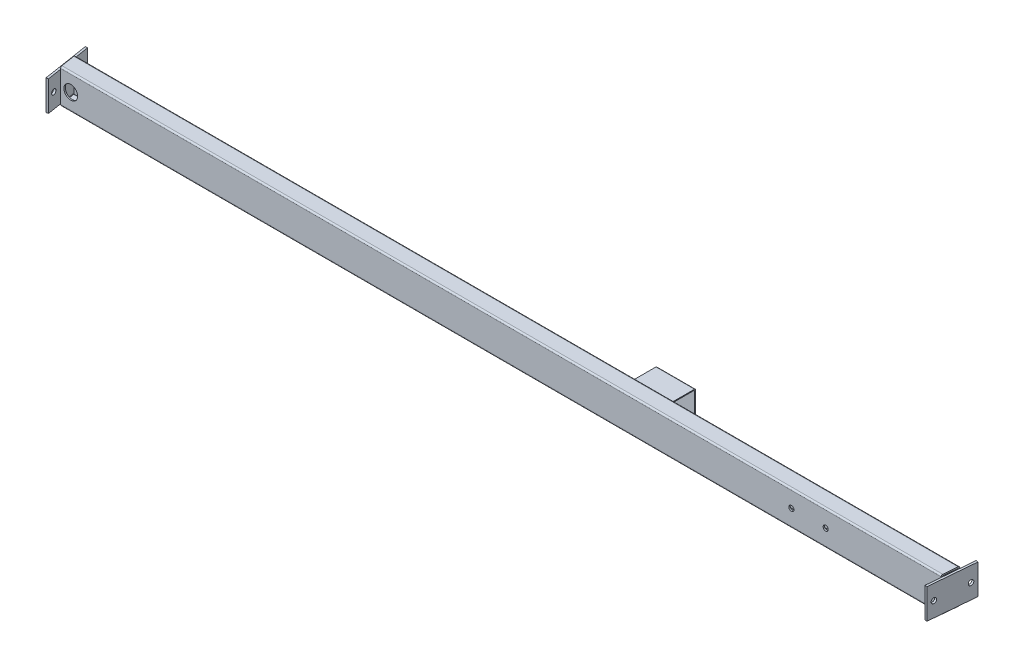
ISO-10303-21;
HEADER;
FILE_DESCRIPTION(('STEP AP214'),'2;1');
FILE_NAME('part.step','',(''),(''),'','','');
FILE_SCHEMA(('AUTOMOTIVE_DESIGN { 1 0 10303 214 1 1 1 1 }'));
ENDSEC;
DATA;
#1=APPLICATION_CONTEXT('core data for automotive mechanical design processes');
#2=APPLICATION_PROTOCOL_DEFINITION('international standard','automotive_design',2000,#1);
#3=PRODUCT_CONTEXT('',#1,'mechanical');
#4=PRODUCT('Part','Part','',(#3));
#5=PRODUCT_RELATED_PRODUCT_CATEGORY('part','',(#4));
#6=PRODUCT_DEFINITION_FORMATION('','',#4);
#7=PRODUCT_DEFINITION_CONTEXT('part definition',#1,'design');
#8=PRODUCT_DEFINITION('design','',#6,#7);
#9=PRODUCT_DEFINITION_SHAPE('','',#8);
#10=(LENGTH_UNIT() NAMED_UNIT(*) SI_UNIT(.MILLI.,.METRE.));
#11=(NAMED_UNIT(*) PLANE_ANGLE_UNIT() SI_UNIT($,.RADIAN.));
#12=(NAMED_UNIT(*) SI_UNIT($,.STERADIAN.) SOLID_ANGLE_UNIT());
#13=UNCERTAINTY_MEASURE_WITH_UNIT(LENGTH_MEASURE(1.E-05),#10,'distance_accuracy_value','');
#14=(GEOMETRIC_REPRESENTATION_CONTEXT(3) GLOBAL_UNCERTAINTY_ASSIGNED_CONTEXT((#13)) GLOBAL_UNIT_ASSIGNED_CONTEXT((#10,
#11,#12)) REPRESENTATION_CONTEXT('',''));
#15=CARTESIAN_POINT('',(0.,0.,0.));
#16=DIRECTION('',(0.,0.,1.));
#17=DIRECTION('',(1.,0.,0.));
#18=AXIS2_PLACEMENT_3D('',#15,#16,#17);
#19=CARTESIAN_POINT('',(1333.,-45.,-44.2264973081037));
#20=DIRECTION('',(0.,-1.,0.));
#21=DIRECTION('',(0.,0.,-1.));
#22=AXIS2_PLACEMENT_3D('',#19,#20,#21);
#23=PLANE('',#22);
#24=DIRECTION('',(-0.86602540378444,0.,-0.499999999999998));
#25=VECTOR('',#24,1.);
#26=CARTESIAN_POINT('',(1343.,-45.,-38.4529946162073));
#27=LINE('',#26,#25);
#28=CARTESIAN_POINT('',(1343.,-45.,-38.4529946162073));
#29=VERTEX_POINT('',#28);
#30=CARTESIAN_POINT('',(1333.,-45.,-44.2264973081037));
#31=VERTEX_POINT('',#30);
#32=EDGE_CURVE('E189',#29,#31,#27,.T.);
#33=ORIENTED_EDGE('',*,*,#32,.T.);
#34=DIRECTION('',(0.,0.,-1.));
#35=VECTOR('',#34,1.);
#36=CARTESIAN_POINT('',(1333.,-45.,-44.2264973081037));
#37=LINE('',#36,#35);
#38=CARTESIAN_POINT('',(1333.,-45.,-55.7735026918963));
#39=VERTEX_POINT('',#38);
#40=EDGE_CURVE('E147',#31,#39,#37,.T.);
#41=ORIENTED_EDGE('',*,*,#40,.T.);
#42=DIRECTION('',(0.866025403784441,0.,-0.499999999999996));
#43=VECTOR('',#42,1.);
#44=CARTESIAN_POINT('',(1333.,-45.,-55.7735026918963));
#45=LINE('',#44,#43);
#46=CARTESIAN_POINT('',(1343.,-45.,-61.5470053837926));
#47=VERTEX_POINT('',#46);
#48=EDGE_CURVE('E160',#39,#47,#45,.T.);
#49=ORIENTED_EDGE('',*,*,#48,.T.);
#50=DIRECTION('',(0.866025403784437,0.,0.500000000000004));
#51=VECTOR('',#50,1.);
#52=CARTESIAN_POINT('',(1343.,-45.,-61.5470053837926));
#53=LINE('',#52,#51);
#54=CARTESIAN_POINT('',(1353.,-45.,-55.7735026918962));
#55=VERTEX_POINT('',#54);
#56=EDGE_CURVE('E154',#47,#55,#53,.T.);
#57=ORIENTED_EDGE('',*,*,#56,.T.);
#58=DIRECTION('',(0.,0.,1.));
#59=VECTOR('',#58,1.);
#60=CARTESIAN_POINT('',(1353.,-45.,-55.7735026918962));
#61=LINE('',#60,#59);
#62=CARTESIAN_POINT('',(1353.,-45.,-44.2264973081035));
#63=VERTEX_POINT('',#62);
#64=EDGE_CURVE('E158',#55,#63,#61,.T.);
#65=ORIENTED_EDGE('',*,*,#64,.T.);
#66=DIRECTION('',(-0.866025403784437,0.,0.500000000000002));
#67=VECTOR('',#66,1.);
#68=CARTESIAN_POINT('',(1353.,-45.,-44.2264973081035));
#69=LINE('',#68,#67);
#70=EDGE_CURVE('E110',#63,#29,#69,.T.);
#71=ORIENTED_EDGE('',*,*,#70,.T.);
#72=EDGE_LOOP('',(#33,#41,#49,#57,#65,#71));
#73=FACE_BOUND('',#72,.T.);
#74=CARTESIAN_POINT('',(1343.,-45.,-50.));
#75=DIRECTION('',(0.,-1.,0.));
#76=DIRECTION('',(0.,0.,-1.));
#77=AXIS2_PLACEMENT_3D('',#74,#75,#76);
#78=CIRCLE('',#77,7.99999999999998);
#79=CARTESIAN_POINT('',(1343.,-45.,-58.));
#80=VERTEX_POINT('',#79);
#81=EDGE_CURVE('E182',#80,#80,#78,.T.);
#82=ORIENTED_EDGE('',*,*,#81,.F.);
#83=EDGE_LOOP('',(#82));
#84=FACE_BOUND('',#83,.T.);
#85=ADVANCED_FACE('F93',(#73,#84),#23,.T.);
#86=CARTESIAN_POINT('',(1333.,-30.,-44.2264973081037));
#87=DIRECTION('',(0.,-1.,0.));
#88=DIRECTION('',(0.,0.,-1.));
#89=AXIS2_PLACEMENT_3D('',#86,#87,#88);
#90=PLANE('',#89);
#91=DIRECTION('',(-0.86602540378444,0.,-0.499999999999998));
#92=VECTOR('',#91,1.);
#93=CARTESIAN_POINT('',(1343.,-30.,-38.4529946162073));
#94=LINE('',#93,#92);
#95=CARTESIAN_POINT('',(1343.,-30.,-38.4529946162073));
#96=VERTEX_POINT('',#95);
#97=CARTESIAN_POINT('',(1333.,-30.,-44.2264973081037));
#98=VERTEX_POINT('',#97);
#99=EDGE_CURVE('E178',#96,#98,#94,.T.);
#100=ORIENTED_EDGE('',*,*,#99,.F.);
#101=DIRECTION('',(-0.866025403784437,0.,0.500000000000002));
#102=VECTOR('',#101,1.);
#103=CARTESIAN_POINT('',(1353.,-30.,-44.2264973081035));
#104=LINE('',#103,#102);
#105=CARTESIAN_POINT('',(1353.,-30.,-44.2264973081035));
#106=VERTEX_POINT('',#105);
#107=EDGE_CURVE('E139',#106,#96,#104,.T.);
#108=ORIENTED_EDGE('',*,*,#107,.F.);
#109=DIRECTION('',(0.,0.,1.));
#110=VECTOR('',#109,1.);
#111=CARTESIAN_POINT('',(1353.,-30.,-55.7735026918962));
#112=LINE('',#111,#110);
#113=CARTESIAN_POINT('',(1353.,-30.,-55.7735026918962));
#114=VERTEX_POINT('',#113);
#115=EDGE_CURVE('E133',#114,#106,#112,.T.);
#116=ORIENTED_EDGE('',*,*,#115,.F.);
#117=DIRECTION('',(0.866025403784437,0.,0.500000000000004));
#118=VECTOR('',#117,1.);
#119=CARTESIAN_POINT('',(1343.,-30.,-61.5470053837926));
#120=LINE('',#119,#118);
#121=CARTESIAN_POINT('',(1343.,-30.,-61.5470053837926));
#122=VERTEX_POINT('',#121);
#123=EDGE_CURVE('E168',#122,#114,#120,.T.);
#124=ORIENTED_EDGE('',*,*,#123,.F.);
#125=DIRECTION('',(0.866025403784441,0.,-0.499999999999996));
#126=VECTOR('',#125,1.);
#127=CARTESIAN_POINT('',(1333.,-30.,-55.7735026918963));
#128=LINE('',#127,#126);
#129=CARTESIAN_POINT('',(1333.,-30.,-55.7735026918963));
#130=VERTEX_POINT('',#129);
#131=EDGE_CURVE('E184',#130,#122,#128,.T.);
#132=ORIENTED_EDGE('',*,*,#131,.F.);
#133=DIRECTION('',(0.,0.,-1.));
#134=VECTOR('',#133,1.);
#135=CARTESIAN_POINT('',(1333.,-30.,-44.2264973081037));
#136=LINE('',#135,#134);
#137=EDGE_CURVE('E181',#98,#130,#136,.T.);
#138=ORIENTED_EDGE('',*,*,#137,.F.);
#139=EDGE_LOOP('',(#100,#108,#116,#124,#132,#138));
#140=FACE_BOUND('',#139,.T.);
#141=CARTESIAN_POINT('',(1343.,-30.,-50.));
#142=DIRECTION('',(0.,-1.,0.));
#143=DIRECTION('',(0.,0.,-1.));
#144=AXIS2_PLACEMENT_3D('',#141,#142,#143);
#145=CIRCLE('',#144,7.99999999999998);
#146=CARTESIAN_POINT('',(1343.,-30.,-58.));
#147=VERTEX_POINT('',#146);
#148=EDGE_CURVE('E282',#147,#147,#145,.T.);
#149=ORIENTED_EDGE('',*,*,#148,.T.);
#150=EDGE_LOOP('',(#149));
#151=FACE_BOUND('',#150,.T.);
#152=ADVANCED_FACE('F198',(#140,#151),#90,.F.);
#153=CARTESIAN_POINT('',(1343.,-45.,-38.4529946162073));
#154=DIRECTION('',(0.499999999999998,0.,-0.86602540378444));
#155=DIRECTION('',(-0.86602540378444,0.,-0.499999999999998));
#156=AXIS2_PLACEMENT_3D('',#153,#154,#155);
#157=PLANE('',#156);
#158=ORIENTED_EDGE('',*,*,#99,.T.);
#159=DIRECTION('',(0.,1.,0.));
#160=VECTOR('',#159,1.);
#161=CARTESIAN_POINT('',(1333.,-45.,-44.2264973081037));
#162=LINE('',#161,#160);
#163=EDGE_CURVE('E13',#31,#98,#162,.T.);
#164=ORIENTED_EDGE('',*,*,#163,.F.);
#165=ORIENTED_EDGE('',*,*,#32,.F.);
#166=DIRECTION('',(0.,1.,0.));
#167=VECTOR('',#166,1.);
#168=CARTESIAN_POINT('',(1343.,-45.,-38.4529946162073));
#169=LINE('',#168,#167);
#170=EDGE_CURVE('E174',#29,#96,#169,.T.);
#171=ORIENTED_EDGE('',*,*,#170,.T.);
#172=EDGE_LOOP('',(#158,#164,#165,#171));
#173=FACE_BOUND('',#172,.T.);
#174=ADVANCED_FACE('F95',(#173),#157,.F.);
#175=CARTESIAN_POINT('',(1333.,-45.,-44.2264973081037));
#176=DIRECTION('',(1.,0.,0.));
#177=DIRECTION('',(0.,0.,-1.));
#178=AXIS2_PLACEMENT_3D('',#175,#176,#177);
#179=PLANE('',#178);
#180=ORIENTED_EDGE('',*,*,#137,.T.);
#181=DIRECTION('',(0.,1.,0.));
#182=VECTOR('',#181,1.);
#183=CARTESIAN_POINT('',(1333.,-45.,-55.7735026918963));
#184=LINE('',#183,#182);
#185=EDGE_CURVE('E102',#39,#130,#184,.T.);
#186=ORIENTED_EDGE('',*,*,#185,.F.);
#187=ORIENTED_EDGE('',*,*,#40,.F.);
#188=ORIENTED_EDGE('',*,*,#163,.T.);
#189=EDGE_LOOP('',(#180,#186,#187,#188));
#190=FACE_BOUND('',#189,.T.);
#191=ADVANCED_FACE('F223',(#190),#179,.F.);
#192=CARTESIAN_POINT('',(1333.,-45.,-55.7735026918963));
#193=DIRECTION('',(0.499999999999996,0.,0.866025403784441));
#194=DIRECTION('',(0.866025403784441,0.,-0.499999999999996));
#195=AXIS2_PLACEMENT_3D('',#192,#193,#194);
#196=PLANE('',#195);
#197=ORIENTED_EDGE('',*,*,#131,.T.);
#198=DIRECTION('',(0.,1.,0.));
#199=VECTOR('',#198,1.);
#200=CARTESIAN_POINT('',(1343.,-45.,-61.5470053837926));
#201=LINE('',#200,#199);
#202=EDGE_CURVE('E169',#47,#122,#201,.T.);
#203=ORIENTED_EDGE('',*,*,#202,.F.);
#204=ORIENTED_EDGE('',*,*,#48,.F.);
#205=ORIENTED_EDGE('',*,*,#185,.T.);
#206=EDGE_LOOP('',(#197,#203,#204,#205));
#207=FACE_BOUND('',#206,.T.);
#208=ADVANCED_FACE('F195',(#207),#196,.F.);
#209=CARTESIAN_POINT('',(1343.,-45.,-61.5470053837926));
#210=DIRECTION('',(-0.500000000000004,0.,0.866025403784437));
#211=DIRECTION('',(0.866025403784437,0.,0.500000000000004));
#212=AXIS2_PLACEMENT_3D('',#209,#210,#211);
#213=PLANE('',#212);
#214=ORIENTED_EDGE('',*,*,#123,.T.);
#215=DIRECTION('',(0.,1.,0.));
#216=VECTOR('',#215,1.);
#217=CARTESIAN_POINT('',(1353.,-45.,-55.7735026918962));
#218=LINE('',#217,#216);
#219=EDGE_CURVE('E165',#55,#114,#218,.T.);
#220=ORIENTED_EDGE('',*,*,#219,.F.);
#221=ORIENTED_EDGE('',*,*,#56,.F.);
#222=ORIENTED_EDGE('',*,*,#202,.T.);
#223=EDGE_LOOP('',(#214,#220,#221,#222));
#224=FACE_BOUND('',#223,.T.);
#225=ADVANCED_FACE('F166',(#224),#213,.F.);
#226=CARTESIAN_POINT('',(1353.,-45.,-55.7735026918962));
#227=DIRECTION('',(-1.,0.,0.));
#228=DIRECTION('',(0.,0.,1.));
#229=AXIS2_PLACEMENT_3D('',#226,#227,#228);
#230=PLANE('',#229);
#231=ORIENTED_EDGE('',*,*,#115,.T.);
#232=DIRECTION('',(0.,1.,0.));
#233=VECTOR('',#232,1.);
#234=CARTESIAN_POINT('',(1353.,-45.,-44.2264973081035));
#235=LINE('',#234,#233);
#236=EDGE_CURVE('E170',#63,#106,#235,.T.);
#237=ORIENTED_EDGE('',*,*,#236,.F.);
#238=ORIENTED_EDGE('',*,*,#64,.F.);
#239=ORIENTED_EDGE('',*,*,#219,.T.);
#240=EDGE_LOOP('',(#231,#237,#238,#239));
#241=FACE_BOUND('',#240,.T.);
#242=ADVANCED_FACE('F172',(#241),#230,.F.);
#243=CARTESIAN_POINT('',(1353.,-45.,-44.2264973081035));
#244=DIRECTION('',(-0.500000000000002,0.,-0.866025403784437));
#245=DIRECTION('',(-0.866025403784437,0.,0.500000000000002));
#246=AXIS2_PLACEMENT_3D('',#243,#244,#245);
#247=PLANE('',#246);
#248=ORIENTED_EDGE('',*,*,#107,.T.);
#249=ORIENTED_EDGE('',*,*,#170,.F.);
#250=ORIENTED_EDGE('',*,*,#70,.F.);
#251=ORIENTED_EDGE('',*,*,#236,.T.);
#252=EDGE_LOOP('',(#248,#249,#250,#251));
#253=FACE_BOUND('',#252,.T.);
#254=ADVANCED_FACE('F203',(#253),#247,.F.);
#255=CARTESIAN_POINT('',(1343.,-45.,-50.));
#256=DIRECTION('',(0.,1.,0.));
#257=DIRECTION('',(0.,0.,1.));
#258=AXIS2_PLACEMENT_3D('',#255,#256,#257);
#259=CYLINDRICAL_SURFACE('',#258,7.99999999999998);
#260=ORIENTED_EDGE('',*,*,#81,.T.);
#261=EDGE_LOOP('',(#260));
#262=FACE_BOUND('',#261,.T.);
#263=ORIENTED_EDGE('',*,*,#148,.F.);
#264=EDGE_LOOP('',(#263));
#265=FACE_BOUND('',#264,.T.);
#266=ADVANCED_FACE('F205',(#262,#265),#259,.F.);
#267=CLOSED_SHELL('',(#85,#152,#174,#191,#208,#225,#242,#254,#266));
#268=MANIFOLD_SOLID_BREP('B2',#267);
#269=CARTESIAN_POINT('',(1388.,27.8,-77.8));
#270=DIRECTION('',(-1.,0.,0.));
#271=DIRECTION('',(0.,0.,1.));
#272=AXIS2_PLACEMENT_3D('',#269,#270,#271);
#273=CYLINDRICAL_SURFACE('',#272,2.2);
#274=CARTESIAN_POINT('',(1298.,27.8,-77.8));
#275=DIRECTION('',(1.,0.,0.));
#276=DIRECTION('',(0.,0.,-1.));
#277=AXIS2_PLACEMENT_3D('',#274,#275,#276);
#278=CIRCLE('',#277,2.2);
#279=CARTESIAN_POINT('',(1298.,27.8,-80.));
#280=VERTEX_POINT('',#279);
#281=CARTESIAN_POINT('',(1298.,30.,-77.8));
#282=VERTEX_POINT('',#281);
#283=EDGE_CURVE('E472',#280,#282,#278,.T.);
#284=ORIENTED_EDGE('',*,*,#283,.T.);
#285=DIRECTION('',(-1.,0.,0.));
#286=VECTOR('',#285,1.);
#287=CARTESIAN_POINT('',(1388.,30.,-77.8));
#288=LINE('',#287,#286);
#289=CARTESIAN_POINT('',(1388.,30.,-77.8));
#290=VERTEX_POINT('',#289);
#291=EDGE_CURVE('E91',#290,#282,#288,.T.);
#292=ORIENTED_EDGE('',*,*,#291,.F.);
#293=CARTESIAN_POINT('',(1388.,27.8,-77.8));
#294=DIRECTION('',(1.,0.,0.));
#295=DIRECTION('',(0.,0.,-1.));
#296=AXIS2_PLACEMENT_3D('',#293,#294,#295);
#297=CIRCLE('',#296,2.2);
#298=CARTESIAN_POINT('',(1388.,27.8,-80.));
#299=VERTEX_POINT('',#298);
#300=EDGE_CURVE('E550',#299,#290,#297,.T.);
#301=ORIENTED_EDGE('',*,*,#300,.F.);
#302=DIRECTION('',(-1.,0.,0.));
#303=VECTOR('',#302,1.);
#304=CARTESIAN_POINT('',(1388.,27.8,-80.));
#305=LINE('',#304,#303);
#306=EDGE_CURVE('E487',#299,#280,#305,.T.);
#307=ORIENTED_EDGE('',*,*,#306,.T.);
#308=EDGE_LOOP('',(#284,#292,#301,#307));
#309=FACE_BOUND('',#308,.T.);
#310=ADVANCED_FACE('F299',(#309),#273,.T.);
#311=CARTESIAN_POINT('',(1388.,30.,-77.8));
#312=DIRECTION('',(0.,-1.,0.));
#313=DIRECTION('',(0.,0.,-1.));
#314=AXIS2_PLACEMENT_3D('',#311,#312,#313);
#315=PLANE('',#314);
#316=DIRECTION('',(0.,0.,1.));
#317=VECTOR('',#316,1.);
#318=CARTESIAN_POINT('',(1298.,30.,-77.8));
#319=LINE('',#318,#317);
#320=CARTESIAN_POINT('',(1298.,30.,-22.2));
#321=VERTEX_POINT('',#320);
#322=EDGE_CURVE('E475',#282,#321,#319,.T.);
#323=ORIENTED_EDGE('',*,*,#322,.T.);
#324=DIRECTION('',(-1.,0.,0.));
#325=VECTOR('',#324,1.);
#326=CARTESIAN_POINT('',(1388.,30.,-22.2));
#327=LINE('',#326,#325);
#328=CARTESIAN_POINT('',(1388.,30.,-22.2));
#329=VERTEX_POINT('',#328);
#330=EDGE_CURVE('E309',#329,#321,#327,.T.);
#331=ORIENTED_EDGE('',*,*,#330,.F.);
#332=DIRECTION('',(0.,0.,1.));
#333=VECTOR('',#332,1.);
#334=CARTESIAN_POINT('',(1388.,30.,-77.8));
#335=LINE('',#334,#333);
#336=EDGE_CURVE('E552',#290,#329,#335,.T.);
#337=ORIENTED_EDGE('',*,*,#336,.F.);
#338=ORIENTED_EDGE('',*,*,#291,.T.);
#339=EDGE_LOOP('',(#323,#331,#337,#338));
#340=FACE_BOUND('',#339,.T.);
#341=ADVANCED_FACE('F587',(#340),#315,.F.);
#342=CARTESIAN_POINT('',(1388.,27.8,-22.2));
#343=DIRECTION('',(-1.,0.,0.));
#344=DIRECTION('',(0.,0.,1.));
#345=AXIS2_PLACEMENT_3D('',#342,#343,#344);
#346=CYLINDRICAL_SURFACE('',#345,2.2);
#347=CARTESIAN_POINT('',(1298.,27.8,-22.2));
#348=DIRECTION('',(1.,0.,0.));
#349=DIRECTION('',(0.,0.,-1.));
#350=AXIS2_PLACEMENT_3D('',#347,#348,#349);
#351=CIRCLE('',#350,2.2);
#352=CARTESIAN_POINT('',(1298.,27.8,-20.));
#353=VERTEX_POINT('',#352);
#354=EDGE_CURVE('E477',#321,#353,#351,.T.);
#355=ORIENTED_EDGE('',*,*,#354,.T.);
#356=DIRECTION('',(-1.,0.,0.));
#357=VECTOR('',#356,1.);
#358=CARTESIAN_POINT('',(1388.,27.8,-20.));
#359=LINE('',#358,#357);
#360=CARTESIAN_POINT('',(1388.,27.8,-20.));
#361=VERTEX_POINT('',#360);
#362=EDGE_CURVE('E494',#361,#353,#359,.T.);
#363=ORIENTED_EDGE('',*,*,#362,.F.);
#364=CARTESIAN_POINT('',(1388.,27.8,-22.2));
#365=DIRECTION('',(1.,0.,0.));
#366=DIRECTION('',(0.,0.,-1.));
#367=AXIS2_PLACEMENT_3D('',#364,#365,#366);
#368=CIRCLE('',#367,2.2);
#369=EDGE_CURVE('E554',#329,#361,#368,.T.);
#370=ORIENTED_EDGE('',*,*,#369,.F.);
#371=ORIENTED_EDGE('',*,*,#330,.T.);
#372=EDGE_LOOP('',(#355,#363,#370,#371));
#373=FACE_BOUND('',#372,.T.);
#374=ADVANCED_FACE('F592',(#373),#346,.T.);
#375=CARTESIAN_POINT('',(1388.,-27.8,-20.));
#376=DIRECTION('',(0.,0.,-1.));
#377=DIRECTION('',(-1.,0.,0.));
#378=AXIS2_PLACEMENT_3D('',#375,#376,#377);
#379=PLANE('',#378);
#380=DIRECTION('',(0.,-1.,0.));
#381=VECTOR('',#380,1.);
#382=CARTESIAN_POINT('',(1298.,-27.8,-20.));
#383=LINE('',#382,#381);
#384=CARTESIAN_POINT('',(1298.,-27.8,-20.));
#385=VERTEX_POINT('',#384);
#386=EDGE_CURVE('E479',#353,#385,#383,.T.);
#387=ORIENTED_EDGE('',*,*,#386,.T.);
#388=DIRECTION('',(-1.,0.,0.));
#389=VECTOR('',#388,1.);
#390=CARTESIAN_POINT('',(1388.,-27.8,-20.));
#391=LINE('',#390,#389);
#392=CARTESIAN_POINT('',(1388.,-27.8,-20.));
#393=VERTEX_POINT('',#392);
#394=EDGE_CURVE('E491',#393,#385,#391,.T.);
#395=ORIENTED_EDGE('',*,*,#394,.F.);
#396=DIRECTION('',(0.,-1.,0.));
#397=VECTOR('',#396,1.);
#398=CARTESIAN_POINT('',(1388.,-27.8,-20.));
#399=LINE('',#398,#397);
#400=EDGE_CURVE('E556',#361,#393,#399,.T.);
#401=ORIENTED_EDGE('',*,*,#400,.F.);
#402=ORIENTED_EDGE('',*,*,#362,.T.);
#403=EDGE_LOOP('',(#387,#395,#401,#402));
#404=FACE_BOUND('',#403,.T.);
#405=ADVANCED_FACE('F562',(#404),#379,.F.);
#406=CARTESIAN_POINT('',(1388.,-27.8,-22.2));
#407=DIRECTION('',(-1.,0.,0.));
#408=DIRECTION('',(0.,0.,1.));
#409=AXIS2_PLACEMENT_3D('',#406,#407,#408);
#410=CYLINDRICAL_SURFACE('',#409,2.2);
#411=CARTESIAN_POINT('',(1298.,-27.8,-22.2));
#412=DIRECTION('',(1.,0.,0.));
#413=DIRECTION('',(0.,0.,-1.));
#414=AXIS2_PLACEMENT_3D('',#411,#412,#413);
#415=CIRCLE('',#414,2.2);
#416=CARTESIAN_POINT('',(1298.,-30.,-22.2));
#417=VERTEX_POINT('',#416);
#418=EDGE_CURVE('E481',#385,#417,#415,.T.);
#419=ORIENTED_EDGE('',*,*,#418,.T.);
#420=DIRECTION('',(-1.,0.,0.));
#421=VECTOR('',#420,1.);
#422=CARTESIAN_POINT('',(1388.,-30.,-22.2));
#423=LINE('',#422,#421);
#424=CARTESIAN_POINT('',(1388.,-30.,-22.2));
#425=VERTEX_POINT('',#424);
#426=EDGE_CURVE('E438',#425,#417,#423,.T.);
#427=ORIENTED_EDGE('',*,*,#426,.F.);
#428=CARTESIAN_POINT('',(1388.,-27.8,-22.2));
#429=DIRECTION('',(1.,0.,0.));
#430=DIRECTION('',(0.,0.,-1.));
#431=AXIS2_PLACEMENT_3D('',#428,#429,#430);
#432=CIRCLE('',#431,2.2);
#433=EDGE_CURVE('E429',#393,#425,#432,.T.);
#434=ORIENTED_EDGE('',*,*,#433,.F.);
#435=ORIENTED_EDGE('',*,*,#394,.T.);
#436=EDGE_LOOP('',(#419,#427,#434,#435));
#437=FACE_BOUND('',#436,.T.);
#438=ADVANCED_FACE('F566',(#437),#410,.T.);
#439=CARTESIAN_POINT('',(1388.,-30.,-22.2));
#440=DIRECTION('',(0.,1.,0.));
#441=DIRECTION('',(0.,0.,1.));
#442=AXIS2_PLACEMENT_3D('',#439,#440,#441);
#443=PLANE('',#442);
#444=CARTESIAN_POINT('',(1343.,-30.,-50.));
#445=DIRECTION('',(0.,-1.,0.));
#446=DIRECTION('',(0.,0.,-1.));
#447=AXIS2_PLACEMENT_3D('',#444,#445,#446);
#448=CIRCLE('',#447,10.0000000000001);
#449=CARTESIAN_POINT('',(1343.,-30.,-60.0000000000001));
#450=VERTEX_POINT('',#449);
#451=EDGE_CURVE('E451',#450,#450,#448,.T.);
#452=ORIENTED_EDGE('',*,*,#451,.F.);
#453=EDGE_LOOP('',(#452));
#454=FACE_BOUND('',#453,.T.);
#455=DIRECTION('',(0.,0.,-1.));
#456=VECTOR('',#455,1.);
#457=CARTESIAN_POINT('',(1298.,-30.,-22.2));
#458=LINE('',#457,#456);
#459=CARTESIAN_POINT('',(1298.,-30.,-77.8));
#460=VERTEX_POINT('',#459);
#461=EDGE_CURVE('E437',#417,#460,#458,.T.);
#462=ORIENTED_EDGE('',*,*,#461,.T.);
#463=DIRECTION('',(-1.,0.,0.));
#464=VECTOR('',#463,1.);
#465=CARTESIAN_POINT('',(1388.,-30.,-77.8));
#466=LINE('',#465,#464);
#467=CARTESIAN_POINT('',(1388.,-30.,-77.8));
#468=VERTEX_POINT('',#467);
#469=EDGE_CURVE('E434',#468,#460,#466,.T.);
#470=ORIENTED_EDGE('',*,*,#469,.F.);
#471=DIRECTION('',(0.,0.,-1.));
#472=VECTOR('',#471,1.);
#473=CARTESIAN_POINT('',(1388.,-30.,-22.2));
#474=LINE('',#473,#472);
#475=EDGE_CURVE('E423',#425,#468,#474,.T.);
#476=ORIENTED_EDGE('',*,*,#475,.F.);
#477=ORIENTED_EDGE('',*,*,#426,.T.);
#478=EDGE_LOOP('',(#462,#470,#476,#477));
#479=FACE_BOUND('',#478,.T.);
#480=ADVANCED_FACE('F435',(#454,#479),#443,.F.);
#481=CARTESIAN_POINT('',(1388.,-27.8,-77.8));
#482=DIRECTION('',(-1.,0.,0.));
#483=DIRECTION('',(0.,0.,1.));
#484=AXIS2_PLACEMENT_3D('',#481,#482,#483);
#485=CYLINDRICAL_SURFACE('',#484,2.2);
#486=CARTESIAN_POINT('',(1298.,-27.8,-77.8));
#487=DIRECTION('',(1.,0.,0.));
#488=DIRECTION('',(0.,0.,-1.));
#489=AXIS2_PLACEMENT_3D('',#486,#487,#488);
#490=CIRCLE('',#489,2.2);
#491=CARTESIAN_POINT('',(1298.,-27.8,-80.));
#492=VERTEX_POINT('',#491);
#493=EDGE_CURVE('E371',#460,#492,#490,.T.);
#494=ORIENTED_EDGE('',*,*,#493,.T.);
#495=DIRECTION('',(-1.,0.,0.));
#496=VECTOR('',#495,1.);
#497=CARTESIAN_POINT('',(1388.,-27.8,-80.));
#498=LINE('',#497,#496);
#499=CARTESIAN_POINT('',(1388.,-27.8,-80.));
#500=VERTEX_POINT('',#499);
#501=EDGE_CURVE('E439',#500,#492,#498,.T.);
#502=ORIENTED_EDGE('',*,*,#501,.F.);
#503=CARTESIAN_POINT('',(1388.,-27.8,-77.8));
#504=DIRECTION('',(1.,0.,0.));
#505=DIRECTION('',(0.,0.,-1.));
#506=AXIS2_PLACEMENT_3D('',#503,#504,#505);
#507=CIRCLE('',#506,2.2);
#508=EDGE_CURVE('E427',#468,#500,#507,.T.);
#509=ORIENTED_EDGE('',*,*,#508,.F.);
#510=ORIENTED_EDGE('',*,*,#469,.T.);
#511=EDGE_LOOP('',(#494,#502,#509,#510));
#512=FACE_BOUND('',#511,.T.);
#513=ADVANCED_FACE('F441',(#512),#485,.T.);
#514=CARTESIAN_POINT('',(1388.,27.8,-22.2));
#515=DIRECTION('',(-1.,0.,0.));
#516=DIRECTION('',(0.,0.,1.));
#517=AXIS2_PLACEMENT_3D('',#514,#515,#516);
#518=CYLINDRICAL_SURFACE('',#517,0.199999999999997);
#519=CARTESIAN_POINT('',(1298.,27.8,-22.2));
#520=DIRECTION('',(1.,0.,0.));
#521=DIRECTION('',(0.,0.,-1.));
#522=AXIS2_PLACEMENT_3D('',#519,#520,#521);
#523=CIRCLE('',#522,0.199999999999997);
#524=CARTESIAN_POINT('',(1298.,28.,-22.2));
#525=VERTEX_POINT('',#524);
#526=CARTESIAN_POINT('',(1298.,27.8,-22.));
#527=VERTEX_POINT('',#526);
#528=EDGE_CURVE('E447',#525,#527,#523,.T.);
#529=ORIENTED_EDGE('',*,*,#528,.F.);
#530=DIRECTION('',(-1.,0.,0.));
#531=VECTOR('',#530,1.);
#532=CARTESIAN_POINT('',(1388.,28.,-22.2));
#533=LINE('',#532,#531);
#534=CARTESIAN_POINT('',(1388.,28.,-22.2));
#535=VERTEX_POINT('',#534);
#536=EDGE_CURVE('E303',#535,#525,#533,.T.);
#537=ORIENTED_EDGE('',*,*,#536,.F.);
#538=CARTESIAN_POINT('',(1388.,27.8,-22.2));
#539=DIRECTION('',(1.,0.,0.));
#540=DIRECTION('',(0.,0.,-1.));
#541=AXIS2_PLACEMENT_3D('',#538,#539,#540);
#542=CIRCLE('',#541,0.199999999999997);
#543=CARTESIAN_POINT('',(1388.,27.8,-22.));
#544=VERTEX_POINT('',#543);
#545=EDGE_CURVE('E486',#535,#544,#542,.T.);
#546=ORIENTED_EDGE('',*,*,#545,.T.);
#547=DIRECTION('',(-1.,0.,0.));
#548=VECTOR('',#547,1.);
#549=CARTESIAN_POINT('',(1388.,27.8,-22.));
#550=LINE('',#549,#548);
#551=EDGE_CURVE('E443',#544,#527,#550,.T.);
#552=ORIENTED_EDGE('',*,*,#551,.T.);
#553=EDGE_LOOP('',(#529,#537,#546,#552));
#554=FACE_BOUND('',#553,.T.);
#555=ADVANCED_FACE('F301',(#554),#518,.F.);
#556=CARTESIAN_POINT('',(1388.,28.,-77.8));
#557=DIRECTION('',(0.,-1.,0.));
#558=DIRECTION('',(0.,0.,-1.));
#559=AXIS2_PLACEMENT_3D('',#556,#557,#558);
#560=PLANE('',#559);
#561=DIRECTION('',(0.,0.,1.));
#562=VECTOR('',#561,1.);
#563=CARTESIAN_POINT('',(1298.,28.,-77.8));
#564=LINE('',#563,#562);
#565=CARTESIAN_POINT('',(1298.,28.,-77.8));
#566=VERTEX_POINT('',#565);
#567=EDGE_CURVE('E450',#566,#525,#564,.T.);
#568=ORIENTED_EDGE('',*,*,#567,.F.);
#569=DIRECTION('',(-1.,0.,0.));
#570=VECTOR('',#569,1.);
#571=CARTESIAN_POINT('',(1388.,28.,-77.8));
#572=LINE('',#571,#570);
#573=CARTESIAN_POINT('',(1388.,28.,-77.8));
#574=VERTEX_POINT('',#573);
#575=EDGE_CURVE('E509',#574,#566,#572,.T.);
#576=ORIENTED_EDGE('',*,*,#575,.F.);
#577=DIRECTION('',(0.,0.,1.));
#578=VECTOR('',#577,1.);
#579=CARTESIAN_POINT('',(1388.,28.,-77.8));
#580=LINE('',#579,#578);
#581=EDGE_CURVE('E518',#574,#535,#580,.T.);
#582=ORIENTED_EDGE('',*,*,#581,.T.);
#583=ORIENTED_EDGE('',*,*,#536,.T.);
#584=EDGE_LOOP('',(#568,#576,#582,#583));
#585=FACE_BOUND('',#584,.T.);
#586=ADVANCED_FACE('F516',(#585),#560,.T.);
#587=CARTESIAN_POINT('',(1388.,27.8,-77.8));
#588=DIRECTION('',(-1.,0.,0.));
#589=DIRECTION('',(0.,0.,1.));
#590=AXIS2_PLACEMENT_3D('',#587,#588,#589);
#591=CYLINDRICAL_SURFACE('',#590,0.199999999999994);
#592=CARTESIAN_POINT('',(1298.,27.8,-77.8));
#593=DIRECTION('',(1.,0.,0.));
#594=DIRECTION('',(0.,0.,-1.));
#595=AXIS2_PLACEMENT_3D('',#592,#593,#594);
#596=CIRCLE('',#595,0.199999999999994);
#597=CARTESIAN_POINT('',(1298.,27.8,-78.));
#598=VERTEX_POINT('',#597);
#599=EDGE_CURVE('E454',#598,#566,#596,.T.);
#600=ORIENTED_EDGE('',*,*,#599,.F.);
#601=DIRECTION('',(-1.,0.,0.));
#602=VECTOR('',#601,1.);
#603=CARTESIAN_POINT('',(1388.,27.8,-78.));
#604=LINE('',#603,#602);
#605=CARTESIAN_POINT('',(1388.,27.8,-78.));
#606=VERTEX_POINT('',#605);
#607=EDGE_CURVE('E508',#606,#598,#604,.T.);
#608=ORIENTED_EDGE('',*,*,#607,.F.);
#609=CARTESIAN_POINT('',(1388.,27.8,-77.8));
#610=DIRECTION('',(1.,0.,0.));
#611=DIRECTION('',(0.,0.,-1.));
#612=AXIS2_PLACEMENT_3D('',#609,#610,#611);
#613=CIRCLE('',#612,0.199999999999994);
#614=EDGE_CURVE('E526',#606,#574,#613,.T.);
#615=ORIENTED_EDGE('',*,*,#614,.T.);
#616=ORIENTED_EDGE('',*,*,#575,.T.);
#617=EDGE_LOOP('',(#600,#608,#615,#616));
#618=FACE_BOUND('',#617,.T.);
#619=ADVANCED_FACE('F524',(#618),#591,.F.);
#620=CARTESIAN_POINT('',(1388.,27.8,-78.));
#621=DIRECTION('',(0.,0.,1.));
#622=DIRECTION('',(1.,0.,0.));
#623=AXIS2_PLACEMENT_3D('',#620,#621,#622);
#624=PLANE('',#623);
#625=DIRECTION('',(0.,1.,0.));
#626=VECTOR('',#625,1.);
#627=CARTESIAN_POINT('',(1298.,27.8,-78.));
#628=LINE('',#627,#626);
#629=CARTESIAN_POINT('',(1298.,-27.8,-78.));
#630=VERTEX_POINT('',#629);
#631=EDGE_CURVE('E457',#630,#598,#628,.T.);
#632=ORIENTED_EDGE('',*,*,#631,.F.);
#633=DIRECTION('',(-1.,0.,0.));
#634=VECTOR('',#633,1.);
#635=CARTESIAN_POINT('',(1388.,-27.8,-78.));
#636=LINE('',#635,#634);
#637=CARTESIAN_POINT('',(1388.,-27.8,-78.));
#638=VERTEX_POINT('',#637);
#639=EDGE_CURVE('E506',#638,#630,#636,.T.);
#640=ORIENTED_EDGE('',*,*,#639,.F.);
#641=DIRECTION('',(0.,1.,0.));
#642=VECTOR('',#641,1.);
#643=CARTESIAN_POINT('',(1388.,27.8,-78.));
#644=LINE('',#643,#642);
#645=EDGE_CURVE('E532',#638,#606,#644,.T.);
#646=ORIENTED_EDGE('',*,*,#645,.T.);
#647=ORIENTED_EDGE('',*,*,#607,.T.);
#648=EDGE_LOOP('',(#632,#640,#646,#647));
#649=FACE_BOUND('',#648,.T.);
#650=ADVANCED_FACE('F535',(#649),#624,.T.);
#651=CARTESIAN_POINT('',(1388.,-27.8,-77.8));
#652=DIRECTION('',(-1.,0.,0.));
#653=DIRECTION('',(0.,0.,1.));
#654=AXIS2_PLACEMENT_3D('',#651,#652,#653);
#655=CYLINDRICAL_SURFACE('',#654,0.200000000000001);
#656=CARTESIAN_POINT('',(1298.,-27.8,-77.8));
#657=DIRECTION('',(1.,0.,0.));
#658=DIRECTION('',(0.,0.,-1.));
#659=AXIS2_PLACEMENT_3D('',#656,#657,#658);
#660=CIRCLE('',#659,0.200000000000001);
#661=CARTESIAN_POINT('',(1298.,-28.,-77.8));
#662=VERTEX_POINT('',#661);
#663=EDGE_CURVE('E460',#662,#630,#660,.T.);
#664=ORIENTED_EDGE('',*,*,#663,.F.);
#665=DIRECTION('',(-1.,0.,0.));
#666=VECTOR('',#665,1.);
#667=CARTESIAN_POINT('',(1388.,-28.,-77.8));
#668=LINE('',#667,#666);
#669=CARTESIAN_POINT('',(1388.,-28.,-77.8));
#670=VERTEX_POINT('',#669);
#671=EDGE_CURVE('E504',#670,#662,#668,.T.);
#672=ORIENTED_EDGE('',*,*,#671,.F.);
#673=CARTESIAN_POINT('',(1388.,-27.8,-77.8));
#674=DIRECTION('',(1.,0.,0.));
#675=DIRECTION('',(0.,0.,-1.));
#676=AXIS2_PLACEMENT_3D('',#673,#674,#675);
#677=CIRCLE('',#676,0.200000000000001);
#678=EDGE_CURVE('E536',#670,#638,#677,.T.);
#679=ORIENTED_EDGE('',*,*,#678,.T.);
#680=ORIENTED_EDGE('',*,*,#639,.T.);
#681=EDGE_LOOP('',(#664,#672,#679,#680));
#682=FACE_BOUND('',#681,.T.);
#683=ADVANCED_FACE('F603',(#682),#655,.F.);
#684=CARTESIAN_POINT('',(1388.,-28.,-22.2));
#685=DIRECTION('',(0.,1.,0.));
#686=DIRECTION('',(0.,0.,1.));
#687=AXIS2_PLACEMENT_3D('',#684,#685,#686);
#688=PLANE('',#687);
#689=CARTESIAN_POINT('',(1343.,-28.,-50.));
#690=DIRECTION('',(0.,1.,0.));
#691=DIRECTION('',(0.,0.,1.));
#692=AXIS2_PLACEMENT_3D('',#689,#690,#691);
#693=CIRCLE('',#692,10.0000000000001);
#694=CARTESIAN_POINT('',(1343.,-28.,-39.9999999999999));
#695=VERTEX_POINT('',#694);
#696=EDGE_CURVE('E778',#695,#695,#693,.F.);
#697=ORIENTED_EDGE('',*,*,#696,.T.);
#698=EDGE_LOOP('',(#697));
#699=FACE_BOUND('',#698,.T.);
#700=DIRECTION('',(0.,0.,-1.));
#701=VECTOR('',#700,1.);
#702=CARTESIAN_POINT('',(1298.,-28.,-22.2));
#703=LINE('',#702,#701);
#704=CARTESIAN_POINT('',(1298.,-28.,-22.2));
#705=VERTEX_POINT('',#704);
#706=EDGE_CURVE('E463',#705,#662,#703,.T.);
#707=ORIENTED_EDGE('',*,*,#706,.F.);
#708=DIRECTION('',(-1.,0.,0.));
#709=VECTOR('',#708,1.);
#710=CARTESIAN_POINT('',(1388.,-28.,-22.2));
#711=LINE('',#710,#709);
#712=CARTESIAN_POINT('',(1388.,-28.,-22.2));
#713=VERTEX_POINT('',#712);
#714=EDGE_CURVE('E502',#713,#705,#711,.T.);
#715=ORIENTED_EDGE('',*,*,#714,.F.);
#716=DIRECTION('',(0.,0.,-1.));
#717=VECTOR('',#716,1.);
#718=CARTESIAN_POINT('',(1388.,-28.,-22.2));
#719=LINE('',#718,#717);
#720=EDGE_CURVE('E538',#713,#670,#719,.T.);
#721=ORIENTED_EDGE('',*,*,#720,.T.);
#722=ORIENTED_EDGE('',*,*,#671,.T.);
#723=EDGE_LOOP('',(#707,#715,#721,#722));
#724=FACE_BOUND('',#723,.T.);
#725=ADVANCED_FACE('F599',(#699,#724),#688,.T.);
#726=CARTESIAN_POINT('',(1388.,-27.8,-22.2));
#727=DIRECTION('',(-1.,0.,0.));
#728=DIRECTION('',(0.,0.,1.));
#729=AXIS2_PLACEMENT_3D('',#726,#727,#728);
#730=CYLINDRICAL_SURFACE('',#729,0.199999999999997);
#731=CARTESIAN_POINT('',(1298.,-27.8,-22.2));
#732=DIRECTION('',(1.,0.,0.));
#733=DIRECTION('',(0.,0.,-1.));
#734=AXIS2_PLACEMENT_3D('',#731,#732,#733);
#735=CIRCLE('',#734,0.199999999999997);
#736=CARTESIAN_POINT('',(1298.,-27.8,-22.));
#737=VERTEX_POINT('',#736);
#738=EDGE_CURVE('E466',#737,#705,#735,.T.);
#739=ORIENTED_EDGE('',*,*,#738,.F.);
#740=DIRECTION('',(-1.,0.,0.));
#741=VECTOR('',#740,1.);
#742=CARTESIAN_POINT('',(1388.,-27.8,-22.));
#743=LINE('',#742,#741);
#744=CARTESIAN_POINT('',(1388.,-27.8,-22.));
#745=VERTEX_POINT('',#744);
#746=EDGE_CURVE('E500',#745,#737,#743,.T.);
#747=ORIENTED_EDGE('',*,*,#746,.F.);
#748=CARTESIAN_POINT('',(1388.,-27.8,-22.2));
#749=DIRECTION('',(1.,0.,0.));
#750=DIRECTION('',(0.,0.,-1.));
#751=AXIS2_PLACEMENT_3D('',#748,#749,#750);
#752=CIRCLE('',#751,0.199999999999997);
#753=EDGE_CURVE('E544',#745,#713,#752,.T.);
#754=ORIENTED_EDGE('',*,*,#753,.T.);
#755=ORIENTED_EDGE('',*,*,#714,.T.);
#756=EDGE_LOOP('',(#739,#747,#754,#755));
#757=FACE_BOUND('',#756,.T.);
#758=ADVANCED_FACE('F581',(#757),#730,.F.);
#759=CARTESIAN_POINT('',(1388.,-27.8,-22.));
#760=DIRECTION('',(0.,0.,-1.));
#761=DIRECTION('',(-1.,0.,0.));
#762=AXIS2_PLACEMENT_3D('',#759,#760,#761);
#763=PLANE('',#762);
#764=DIRECTION('',(0.,-1.,0.));
#765=VECTOR('',#764,1.);
#766=CARTESIAN_POINT('',(1298.,-27.8,-22.));
#767=LINE('',#766,#765);
#768=EDGE_CURVE('E469',#527,#737,#767,.T.);
#769=ORIENTED_EDGE('',*,*,#768,.F.);
#770=ORIENTED_EDGE('',*,*,#551,.F.);
#771=DIRECTION('',(0.,-1.,0.));
#772=VECTOR('',#771,1.);
#773=CARTESIAN_POINT('',(1388.,-27.8,-22.));
#774=LINE('',#773,#772);
#775=EDGE_CURVE('E547',#544,#745,#774,.T.);
#776=ORIENTED_EDGE('',*,*,#775,.T.);
#777=ORIENTED_EDGE('',*,*,#746,.T.);
#778=EDGE_LOOP('',(#769,#770,#776,#777));
#779=FACE_BOUND('',#778,.T.);
#780=ADVANCED_FACE('F574',(#779),#763,.T.);
#781=CARTESIAN_POINT('',(1388.,27.8,-80.));
#782=DIRECTION('',(0.,0.,1.));
#783=DIRECTION('',(1.,0.,0.));
#784=AXIS2_PLACEMENT_3D('',#781,#782,#783);
#785=PLANE('',#784);
#786=DIRECTION('',(0.,1.,0.));
#787=VECTOR('',#786,1.);
#788=CARTESIAN_POINT('',(1298.,27.8,-80.));
#789=LINE('',#788,#787);
#790=EDGE_CURVE('E377',#492,#280,#789,.T.);
#791=ORIENTED_EDGE('',*,*,#790,.T.);
#792=ORIENTED_EDGE('',*,*,#306,.F.);
#793=DIRECTION('',(0.,1.,0.));
#794=VECTOR('',#793,1.);
#795=CARTESIAN_POINT('',(1388.,27.8,-80.));
#796=LINE('',#795,#794);
#797=EDGE_CURVE('E318',#500,#299,#796,.T.);
#798=ORIENTED_EDGE('',*,*,#797,.F.);
#799=ORIENTED_EDGE('',*,*,#501,.T.);
#800=EDGE_LOOP('',(#791,#792,#798,#799));
#801=FACE_BOUND('',#800,.T.);
#802=ADVANCED_FACE('F572',(#801),#785,.F.);
#803=CARTESIAN_POINT('',(1388.,27.8,-77.8));
#804=DIRECTION('',(1.,0.,0.));
#805=DIRECTION('',(0.,0.,-1.));
#806=AXIS2_PLACEMENT_3D('',#803,#804,#805);
#807=PLANE('',#806);
#808=ORIENTED_EDGE('',*,*,#545,.F.);
#809=ORIENTED_EDGE('',*,*,#581,.F.);
#810=ORIENTED_EDGE('',*,*,#614,.F.);
#811=ORIENTED_EDGE('',*,*,#645,.F.);
#812=ORIENTED_EDGE('',*,*,#678,.F.);
#813=ORIENTED_EDGE('',*,*,#720,.F.);
#814=ORIENTED_EDGE('',*,*,#753,.F.);
#815=ORIENTED_EDGE('',*,*,#775,.F.);
#816=EDGE_LOOP('',(#808,#809,#810,#811,#812,#813,#814,#815));
#817=FACE_BOUND('',#816,.T.);
#818=ORIENTED_EDGE('',*,*,#300,.T.);
#819=ORIENTED_EDGE('',*,*,#336,.T.);
#820=ORIENTED_EDGE('',*,*,#369,.T.);
#821=ORIENTED_EDGE('',*,*,#400,.T.);
#822=ORIENTED_EDGE('',*,*,#433,.T.);
#823=ORIENTED_EDGE('',*,*,#475,.T.);
#824=ORIENTED_EDGE('',*,*,#508,.T.);
#825=ORIENTED_EDGE('',*,*,#797,.T.);
#826=EDGE_LOOP('',(#818,#819,#820,#821,#822,#823,#824,#825));
#827=FACE_BOUND('',#826,.T.);
#828=ADVANCED_FACE('F425',(#817,#827),#807,.T.);
#829=CARTESIAN_POINT('',(1298.,27.8,-77.8));
#830=DIRECTION('',(1.,0.,0.));
#831=DIRECTION('',(0.,0.,-1.));
#832=AXIS2_PLACEMENT_3D('',#829,#830,#831);
#833=PLANE('',#832);
#834=ORIENTED_EDGE('',*,*,#528,.T.);
#835=ORIENTED_EDGE('',*,*,#768,.T.);
#836=ORIENTED_EDGE('',*,*,#738,.T.);
#837=ORIENTED_EDGE('',*,*,#706,.T.);
#838=ORIENTED_EDGE('',*,*,#663,.T.);
#839=ORIENTED_EDGE('',*,*,#631,.T.);
#840=ORIENTED_EDGE('',*,*,#599,.T.);
#841=ORIENTED_EDGE('',*,*,#567,.T.);
#842=EDGE_LOOP('',(#834,#835,#836,#837,#838,#839,#840,#841));
#843=FACE_BOUND('',#842,.T.);
#844=ORIENTED_EDGE('',*,*,#283,.F.);
#845=ORIENTED_EDGE('',*,*,#790,.F.);
#846=ORIENTED_EDGE('',*,*,#493,.F.);
#847=ORIENTED_EDGE('',*,*,#461,.F.);
#848=ORIENTED_EDGE('',*,*,#418,.F.);
#849=ORIENTED_EDGE('',*,*,#386,.F.);
#850=ORIENTED_EDGE('',*,*,#354,.F.);
#851=ORIENTED_EDGE('',*,*,#322,.F.);
#852=EDGE_LOOP('',(#844,#845,#846,#847,#848,#849,#850,#851));
#853=FACE_BOUND('',#852,.T.);
#854=ADVANCED_FACE('F521',(#843,#853),#833,.F.);
#855=CARTESIAN_POINT('',(1343.,40.001,-50.));
#856=DIRECTION('',(0.,-1.,0.));
#857=DIRECTION('',(0.,0.,-1.));
#858=AXIS2_PLACEMENT_3D('',#855,#856,#857);
#859=CYLINDRICAL_SURFACE('',#858,10.0000000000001);
#860=ORIENTED_EDGE('',*,*,#696,.F.);
#861=EDGE_LOOP('',(#860));
#862=FACE_BOUND('',#861,.T.);
#863=ORIENTED_EDGE('',*,*,#451,.T.);
#864=EDGE_LOOP('',(#863));
#865=FACE_BOUND('',#864,.T.);
#866=ADVANCED_FACE('F667',(#862,#865),#859,.F.);
#867=CLOSED_SHELL('',(#310,#341,#374,#405,#438,#480,#513,#555,#586,#619,#650,#683,#725,#758,
#780,#802,#828,#854,#866));
#868=MANIFOLD_SOLID_BREP('B7',#867);
#869=CARTESIAN_POINT('',(2073.03805756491,-35.,-54.5068521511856));
#870=DIRECTION('',(-0.996194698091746,0.,-0.0871557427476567));
#871=DIRECTION('',(-0.0871557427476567,0.,0.996194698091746));
#872=AXIS2_PLACEMENT_3D('',#869,#870,#871);
#873=PLANE('',#872);
#874=CARTESIAN_POINT('',(2071.7307214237,0.,-39.5639316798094));
#875=DIRECTION('',(0.996194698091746,0.,0.0871557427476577));
#876=DIRECTION('',(0.0871557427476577,0.,-0.996194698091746));
#877=AXIS2_PLACEMENT_3D('',#874,#875,#876);
#878=CIRCLE('',#877,6.);
#879=CARTESIAN_POINT('',(2072.25365588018,0.,-45.5410998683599));
#880=VERTEX_POINT('',#879);
#881=EDGE_CURVE('E870',#880,#880,#878,.T.);
#882=ORIENTED_EDGE('',*,*,#881,.F.);
#883=EDGE_LOOP('',(#882));
#884=FACE_BOUND('',#883,.T.);
#885=DIRECTION('',(0.,1.,0.));
#886=VECTOR('',#885,1.);
#887=CARTESIAN_POINT('',(2073.03805756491,35.,-54.5068521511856));
#888=LINE('',#887,#886);
#889=CARTESIAN_POINT('',(2073.03805756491,-35.,-54.5068521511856));
#890=VERTEX_POINT('',#889);
#891=CARTESIAN_POINT('',(2073.03805756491,35.,-54.5068521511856));
#892=VERTEX_POINT('',#891);
#893=EDGE_CURVE('E855',#890,#892,#888,.T.);
#894=ORIENTED_EDGE('',*,*,#893,.T.);
#895=DIRECTION('',(-0.0871557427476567,0.,0.996194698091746));
#896=VECTOR('',#895,1.);
#897=CARTESIAN_POINT('',(2073.03805756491,35.,-54.5068521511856));
#898=LINE('',#897,#896);
#899=CARTESIAN_POINT('',(2063.45092586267,35.,55.0745646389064));
#900=VERTEX_POINT('',#899);
#901=EDGE_CURVE('E850',#892,#900,#898,.T.);
#902=ORIENTED_EDGE('',*,*,#901,.T.);
#903=DIRECTION('',(0.,-1.,0.));
#904=VECTOR('',#903,1.);
#905=CARTESIAN_POINT('',(2063.45092586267,35.,55.0745646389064));
#906=LINE('',#905,#904);
#907=CARTESIAN_POINT('',(2063.45092586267,-35.,55.0745646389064));
#908=VERTEX_POINT('',#907);
#909=EDGE_CURVE('E853',#900,#908,#906,.T.);
#910=ORIENTED_EDGE('',*,*,#909,.T.);
#911=DIRECTION('',(0.0871557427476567,0.,-0.996194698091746));
#912=VECTOR('',#911,1.);
#913=CARTESIAN_POINT('',(2073.03805756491,-35.,-54.5068521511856));
#914=LINE('',#913,#912);
#915=EDGE_CURVE('E820',#908,#890,#914,.T.);
#916=ORIENTED_EDGE('',*,*,#915,.T.);
#917=EDGE_LOOP('',(#894,#902,#910,#916));
#918=FACE_BOUND('',#917,.T.);
#919=CARTESIAN_POINT('',(2064.75826200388,0.,40.1316441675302));
#920=DIRECTION('',(0.996194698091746,0.,0.0871557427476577));
#921=DIRECTION('',(0.0871557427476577,0.,-0.996194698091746));
#922=AXIS2_PLACEMENT_3D('',#919,#920,#921);
#923=CIRCLE('',#922,6.);
#924=CARTESIAN_POINT('',(2065.28119646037,0.,34.1544759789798));
#925=VERTEX_POINT('',#924);
#926=EDGE_CURVE('E885',#925,#925,#923,.T.);
#927=ORIENTED_EDGE('',*,*,#926,.F.);
#928=EDGE_LOOP('',(#927));
#929=FACE_BOUND('',#928,.T.);
#930=ADVANCED_FACE('F803',(#884,#918,#929),#873,.F.);
#931=CARTESIAN_POINT('',(2068.05708407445,-35.,-54.9426308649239));
#932=DIRECTION('',(-0.996194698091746,0.,-0.0871557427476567));
#933=DIRECTION('',(-0.0871557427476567,0.,0.996194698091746));
#934=AXIS2_PLACEMENT_3D('',#931,#932,#933);
#935=PLANE('',#934);
#936=CARTESIAN_POINT('',(2066.74974793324,0.,-39.9997103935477));
#937=DIRECTION('',(0.996194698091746,0.,0.0871557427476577));
#938=DIRECTION('',(0.0871557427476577,0.,-0.996194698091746));
#939=AXIS2_PLACEMENT_3D('',#936,#937,#938);
#940=CIRCLE('',#939,6.);
#941=CARTESIAN_POINT('',(2067.27268238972,0.,-45.9768785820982));
#942=VERTEX_POINT('',#941);
#943=EDGE_CURVE('E882',#942,#942,#940,.T.);
#944=ORIENTED_EDGE('',*,*,#943,.T.);
#945=EDGE_LOOP('',(#944));
#946=FACE_BOUND('',#945,.T.);
#947=DIRECTION('',(0.,1.,0.));
#948=VECTOR('',#947,1.);
#949=CARTESIAN_POINT('',(2068.05708407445,35.,-54.9426308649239));
#950=LINE('',#949,#948);
#951=CARTESIAN_POINT('',(2068.05708407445,-35.,-54.9426308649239));
#952=VERTEX_POINT('',#951);
#953=CARTESIAN_POINT('',(2068.05708407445,35.,-54.9426308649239));
#954=VERTEX_POINT('',#953);
#955=EDGE_CURVE('E867',#952,#954,#950,.T.);
#956=ORIENTED_EDGE('',*,*,#955,.F.);
#957=DIRECTION('',(0.0871557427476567,0.,-0.996194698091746));
#958=VECTOR('',#957,1.);
#959=CARTESIAN_POINT('',(2068.05708407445,-35.,-54.9426308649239));
#960=LINE('',#959,#958);
#961=CARTESIAN_POINT('',(2058.46995237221,-35.,54.6387859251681));
#962=VERTEX_POINT('',#961);
#963=EDGE_CURVE('E843',#962,#952,#960,.T.);
#964=ORIENTED_EDGE('',*,*,#963,.F.);
#965=DIRECTION('',(0.,-1.,0.));
#966=VECTOR('',#965,1.);
#967=CARTESIAN_POINT('',(2058.46995237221,35.,54.6387859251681));
#968=LINE('',#967,#966);
#969=CARTESIAN_POINT('',(2058.46995237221,35.,54.6387859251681));
#970=VERTEX_POINT('',#969);
#971=EDGE_CURVE('E837',#970,#962,#968,.T.);
#972=ORIENTED_EDGE('',*,*,#971,.F.);
#973=DIRECTION('',(-0.0871557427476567,0.,0.996194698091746));
#974=VECTOR('',#973,1.);
#975=CARTESIAN_POINT('',(2068.05708407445,35.,-54.9426308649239));
#976=LINE('',#975,#974);
#977=EDGE_CURVE('E859',#954,#970,#976,.T.);
#978=ORIENTED_EDGE('',*,*,#977,.F.);
#979=EDGE_LOOP('',(#956,#964,#972,#978));
#980=FACE_BOUND('',#979,.T.);
#981=CARTESIAN_POINT('',(2059.77728851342,0.,39.6958654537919));
#982=DIRECTION('',(0.996194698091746,0.,0.0871557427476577));
#983=DIRECTION('',(0.0871557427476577,0.,-0.996194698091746));
#984=AXIS2_PLACEMENT_3D('',#981,#982,#983);
#985=CIRCLE('',#984,6.);
#986=CARTESIAN_POINT('',(2060.30022296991,0.,33.7186972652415));
#987=VERTEX_POINT('',#986);
#988=EDGE_CURVE('E888',#987,#987,#985,.T.);
#989=ORIENTED_EDGE('',*,*,#988,.T.);
#990=EDGE_LOOP('',(#989));
#991=FACE_BOUND('',#990,.T.);
#992=ADVANCED_FACE('F878',(#946,#980,#991),#935,.T.);
#993=CARTESIAN_POINT('',(2073.03805756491,35.,-54.5068521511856));
#994=DIRECTION('',(-0.0871557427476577,0.,0.996194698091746));
#995=DIRECTION('',(0.996194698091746,0.,0.0871557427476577));
#996=AXIS2_PLACEMENT_3D('',#993,#994,#995);
#997=PLANE('',#996);
#998=ORIENTED_EDGE('',*,*,#955,.T.);
#999=DIRECTION('',(-0.996194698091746,0.,-0.0871557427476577));
#1000=VECTOR('',#999,1.);
#1001=CARTESIAN_POINT('',(2073.03805756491,35.,-54.5068521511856));
#1002=LINE('',#1001,#1000);
#1003=EDGE_CURVE('E297',#892,#954,#1002,.T.);
#1004=ORIENTED_EDGE('',*,*,#1003,.F.);
#1005=ORIENTED_EDGE('',*,*,#893,.F.);
#1006=DIRECTION('',(-0.996194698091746,0.,-0.0871557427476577));
#1007=VECTOR('',#1006,1.);
#1008=CARTESIAN_POINT('',(2073.03805756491,-35.,-54.5068521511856));
#1009=LINE('',#1008,#1007);
#1010=EDGE_CURVE('E863',#890,#952,#1009,.T.);
#1011=ORIENTED_EDGE('',*,*,#1010,.T.);
#1012=EDGE_LOOP('',(#998,#1004,#1005,#1011));
#1013=FACE_BOUND('',#1012,.T.);
#1014=ADVANCED_FACE('F805',(#1013),#997,.F.);
#1015=CARTESIAN_POINT('',(2073.03805756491,35.,-54.5068521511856));
#1016=DIRECTION('',(0.,-1.,0.));
#1017=DIRECTION('',(0.,0.,-1.));
#1018=AXIS2_PLACEMENT_3D('',#1015,#1016,#1017);
#1019=PLANE('',#1018);
#1020=ORIENTED_EDGE('',*,*,#977,.T.);
#1021=DIRECTION('',(-0.996194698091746,0.,-0.0871557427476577));
#1022=VECTOR('',#1021,1.);
#1023=CARTESIAN_POINT('',(2063.45092586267,35.,55.0745646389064));
#1024=LINE('',#1023,#1022);
#1025=EDGE_CURVE('E812',#900,#970,#1024,.T.);
#1026=ORIENTED_EDGE('',*,*,#1025,.F.);
#1027=ORIENTED_EDGE('',*,*,#901,.F.);
#1028=ORIENTED_EDGE('',*,*,#1003,.T.);
#1029=EDGE_LOOP('',(#1020,#1026,#1027,#1028));
#1030=FACE_BOUND('',#1029,.T.);
#1031=ADVANCED_FACE('F858',(#1030),#1019,.F.);
#1032=CARTESIAN_POINT('',(2063.45092586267,35.,55.0745646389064));
#1033=DIRECTION('',(0.0871557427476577,0.,-0.996194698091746));
#1034=DIRECTION('',(-0.996194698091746,0.,-0.0871557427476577));
#1035=AXIS2_PLACEMENT_3D('',#1032,#1033,#1034);
#1036=PLANE('',#1035);
#1037=ORIENTED_EDGE('',*,*,#971,.T.);
#1038=DIRECTION('',(-0.996194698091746,0.,-0.0871557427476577));
#1039=VECTOR('',#1038,1.);
#1040=CARTESIAN_POINT('',(2063.45092586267,-35.,55.0745646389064));
#1041=LINE('',#1040,#1039);
#1042=EDGE_CURVE('E860',#908,#962,#1041,.T.);
#1043=ORIENTED_EDGE('',*,*,#1042,.F.);
#1044=ORIENTED_EDGE('',*,*,#909,.F.);
#1045=ORIENTED_EDGE('',*,*,#1025,.T.);
#1046=EDGE_LOOP('',(#1037,#1043,#1044,#1045));
#1047=FACE_BOUND('',#1046,.T.);
#1048=ADVANCED_FACE('F861',(#1047),#1036,.F.);
#1049=CARTESIAN_POINT('',(2073.03805756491,-35.,-54.5068521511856));
#1050=DIRECTION('',(0.,1.,0.));
#1051=DIRECTION('',(0.,0.,1.));
#1052=AXIS2_PLACEMENT_3D('',#1049,#1050,#1051);
#1053=PLANE('',#1052);
#1054=ORIENTED_EDGE('',*,*,#963,.T.);
#1055=ORIENTED_EDGE('',*,*,#1010,.F.);
#1056=ORIENTED_EDGE('',*,*,#915,.F.);
#1057=ORIENTED_EDGE('',*,*,#1042,.T.);
#1058=EDGE_LOOP('',(#1054,#1055,#1056,#1057));
#1059=FACE_BOUND('',#1058,.T.);
#1060=ADVANCED_FACE('F875',(#1059),#1053,.F.);
#1061=CARTESIAN_POINT('',(2071.7307214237,0.,-39.5639316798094));
#1062=DIRECTION('',(-0.996194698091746,0.,-0.0871557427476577));
#1063=DIRECTION('',(-0.0871557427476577,0.,0.996194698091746));
#1064=AXIS2_PLACEMENT_3D('',#1061,#1062,#1063);
#1065=CYLINDRICAL_SURFACE('',#1064,6.);
#1066=ORIENTED_EDGE('',*,*,#881,.T.);
#1067=EDGE_LOOP('',(#1066));
#1068=FACE_BOUND('',#1067,.T.);
#1069=ORIENTED_EDGE('',*,*,#943,.F.);
#1070=EDGE_LOOP('',(#1069));
#1071=FACE_BOUND('',#1070,.T.);
#1072=ADVANCED_FACE('F906',(#1068,#1071),#1065,.F.);
#1073=CARTESIAN_POINT('',(2064.75826200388,0.,40.1316441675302));
#1074=DIRECTION('',(-0.996194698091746,0.,-0.0871557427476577));
#1075=DIRECTION('',(-0.0871557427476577,0.,0.996194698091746));
#1076=AXIS2_PLACEMENT_3D('',#1073,#1074,#1075);
#1077=CYLINDRICAL_SURFACE('',#1076,6.);
#1078=ORIENTED_EDGE('',*,*,#926,.T.);
#1079=EDGE_LOOP('',(#1078));
#1080=FACE_BOUND('',#1079,.T.);
#1081=ORIENTED_EDGE('',*,*,#988,.F.);
#1082=EDGE_LOOP('',(#1081));
#1083=FACE_BOUND('',#1082,.T.);
#1084=ADVANCED_FACE('F894',(#1080,#1083),#1077,.F.);
#1085=CLOSED_SHELL('',(#930,#992,#1014,#1031,#1048,#1060,#1072,#1084));
#1086=MANIFOLD_SOLID_BREP('B85',#1085);
#1087=CARTESIAN_POINT('',(-10.4521673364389,35.,-54.0301212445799));
#1088=DIRECTION('',(0.987688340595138,0.,-0.156434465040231));
#1089=DIRECTION('',(-0.156434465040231,0.,-0.987688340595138));
#1090=AXIS2_PLACEMENT_3D('',#1087,#1088,#1089);
#1091=PLANE('',#1090);
#1092=CARTESIAN_POINT('',(-8.10565036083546,0.,-39.2147961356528));
#1093=DIRECTION('',(-0.987688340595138,0.,0.156434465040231));
#1094=DIRECTION('',(0.156434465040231,0.,0.987688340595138));
#1095=AXIS2_PLACEMENT_3D('',#1092,#1093,#1094);
#1096=CIRCLE('',#1095,6.);
#1097=CARTESIAN_POINT('',(-7.16704357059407,0.,-33.288666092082));
#1098=VERTEX_POINT('',#1097);
#1099=EDGE_CURVE('E1044',#1098,#1098,#1096,.T.);
#1100=ORIENTED_EDGE('',*,*,#1099,.F.);
#1101=EDGE_LOOP('',(#1100));
#1102=FACE_BOUND('',#1101,.T.);
#1103=DIRECTION('',(0.,-1.,0.));
#1104=VECTOR('',#1103,1.);
#1105=CARTESIAN_POINT('',(-10.4521673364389,-35.,-54.0301212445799));
#1106=LINE('',#1105,#1104);
#1107=CARTESIAN_POINT('',(-10.4521673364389,35.,-54.0301212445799));
#1108=VERTEX_POINT('',#1107);
#1109=CARTESIAN_POINT('',(-10.4521673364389,-35.,-54.0301212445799));
#1110=VERTEX_POINT('',#1109);
#1111=EDGE_CURVE('E1029',#1108,#1110,#1106,.T.);
#1112=ORIENTED_EDGE('',*,*,#1111,.T.);
#1113=DIRECTION('',(0.156434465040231,0.,0.987688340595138));
#1114=VECTOR('',#1113,1.);
#1115=CARTESIAN_POINT('',(-10.4521673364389,-35.,-54.0301212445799));
#1116=LINE('',#1115,#1114);
#1117=CARTESIAN_POINT('',(6.75562381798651,-35.,54.6155962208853));
#1118=VERTEX_POINT('',#1117);
#1119=EDGE_CURVE('E1024',#1110,#1118,#1116,.T.);
#1120=ORIENTED_EDGE('',*,*,#1119,.T.);
#1121=DIRECTION('',(0.,1.,0.));
#1122=VECTOR('',#1121,1.);
#1123=CARTESIAN_POINT('',(6.75562381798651,-35.,54.6155962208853));
#1124=LINE('',#1123,#1122);
#1125=CARTESIAN_POINT('',(6.75562381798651,35.,54.6155962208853));
#1126=VERTEX_POINT('',#1125);
#1127=EDGE_CURVE('E1027',#1118,#1126,#1124,.T.);
#1128=ORIENTED_EDGE('',*,*,#1127,.T.);
#1129=DIRECTION('',(-0.156434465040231,0.,-0.987688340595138));
#1130=VECTOR('',#1129,1.);
#1131=CARTESIAN_POINT('',(-10.4521673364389,35.,-54.0301212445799));
#1132=LINE('',#1131,#1130);
#1133=EDGE_CURVE('E994',#1126,#1108,#1132,.T.);
#1134=ORIENTED_EDGE('',*,*,#1133,.T.);
#1135=EDGE_LOOP('',(#1112,#1120,#1128,#1134));
#1136=FACE_BOUND('',#1135,.T.);
#1137=CARTESIAN_POINT('',(4.40910684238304,0.,39.8002711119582));
#1138=DIRECTION('',(-0.987688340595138,0.,0.156434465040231));
#1139=DIRECTION('',(0.156434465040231,0.,0.987688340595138));
#1140=AXIS2_PLACEMENT_3D('',#1137,#1138,#1139);
#1141=CIRCLE('',#1140,6.);
#1142=CARTESIAN_POINT('',(5.34771363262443,0.,45.726401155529));
#1143=VERTEX_POINT('',#1142);
#1144=EDGE_CURVE('E1059',#1143,#1143,#1141,.T.);
#1145=ORIENTED_EDGE('',*,*,#1144,.F.);
#1146=EDGE_LOOP('',(#1145));
#1147=FACE_BOUND('',#1146,.T.);
#1148=ADVANCED_FACE('F977',(#1102,#1136,#1147),#1091,.F.);
#1149=CARTESIAN_POINT('',(-5.51372563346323,35.,-54.812293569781));
#1150=DIRECTION('',(0.987688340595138,0.,-0.156434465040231));
#1151=DIRECTION('',(-0.156434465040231,0.,-0.987688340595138));
#1152=AXIS2_PLACEMENT_3D('',#1149,#1150,#1151);
#1153=PLANE('',#1152);
#1154=CARTESIAN_POINT('',(-3.16720865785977,0.,-39.996968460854));
#1155=DIRECTION('',(-0.987688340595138,0.,0.156434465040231));
#1156=DIRECTION('',(0.156434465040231,0.,0.987688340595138));
#1157=AXIS2_PLACEMENT_3D('',#1154,#1155,#1156);
#1158=CIRCLE('',#1157,6.);
#1159=CARTESIAN_POINT('',(-2.22860186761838,0.,-34.0708384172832));
#1160=VERTEX_POINT('',#1159);
#1161=EDGE_CURVE('E1056',#1160,#1160,#1158,.T.);
#1162=ORIENTED_EDGE('',*,*,#1161,.T.);
#1163=EDGE_LOOP('',(#1162));
#1164=FACE_BOUND('',#1163,.T.);
#1165=DIRECTION('',(0.,-1.,0.));
#1166=VECTOR('',#1165,1.);
#1167=CARTESIAN_POINT('',(-5.51372563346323,-35.,-54.812293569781));
#1168=LINE('',#1167,#1166);
#1169=CARTESIAN_POINT('',(-5.51372563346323,35.,-54.812293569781));
#1170=VERTEX_POINT('',#1169);
#1171=CARTESIAN_POINT('',(-5.51372563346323,-35.,-54.812293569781));
#1172=VERTEX_POINT('',#1171);
#1173=EDGE_CURVE('E1041',#1170,#1172,#1168,.T.);
#1174=ORIENTED_EDGE('',*,*,#1173,.F.);
#1175=DIRECTION('',(-0.156434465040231,0.,-0.987688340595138));
#1176=VECTOR('',#1175,1.);
#1177=CARTESIAN_POINT('',(-5.51372563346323,35.,-54.812293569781));
#1178=LINE('',#1177,#1176);
#1179=CARTESIAN_POINT('',(11.6940655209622,35.,53.8334238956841));
#1180=VERTEX_POINT('',#1179);
#1181=EDGE_CURVE('E1017',#1180,#1170,#1178,.T.);
#1182=ORIENTED_EDGE('',*,*,#1181,.F.);
#1183=DIRECTION('',(0.,1.,0.));
#1184=VECTOR('',#1183,1.);
#1185=CARTESIAN_POINT('',(11.6940655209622,-35.,53.8334238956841));
#1186=LINE('',#1185,#1184);
#1187=CARTESIAN_POINT('',(11.6940655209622,-35.,53.8334238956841));
#1188=VERTEX_POINT('',#1187);
#1189=EDGE_CURVE('E1011',#1188,#1180,#1186,.T.);
#1190=ORIENTED_EDGE('',*,*,#1189,.F.);
#1191=DIRECTION('',(0.156434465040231,0.,0.987688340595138));
#1192=VECTOR('',#1191,1.);
#1193=CARTESIAN_POINT('',(-5.51372563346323,-35.,-54.812293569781));
#1194=LINE('',#1193,#1192);
#1195=EDGE_CURVE('E1033',#1172,#1188,#1194,.T.);
#1196=ORIENTED_EDGE('',*,*,#1195,.F.);
#1197=EDGE_LOOP('',(#1174,#1182,#1190,#1196));
#1198=FACE_BOUND('',#1197,.T.);
#1199=CARTESIAN_POINT('',(9.34754854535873,0.,39.018098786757));
#1200=DIRECTION('',(-0.987688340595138,0.,0.156434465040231));
#1201=DIRECTION('',(0.156434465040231,0.,0.987688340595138));
#1202=AXIS2_PLACEMENT_3D('',#1199,#1200,#1201);
#1203=CIRCLE('',#1202,6.);
#1204=CARTESIAN_POINT('',(10.2861553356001,0.,44.9442288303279));
#1205=VERTEX_POINT('',#1204);
#1206=EDGE_CURVE('E1062',#1205,#1205,#1203,.T.);
#1207=ORIENTED_EDGE('',*,*,#1206,.T.);
#1208=EDGE_LOOP('',(#1207));
#1209=FACE_BOUND('',#1208,.T.);
#1210=ADVANCED_FACE('F1052',(#1164,#1198,#1209),#1153,.T.);
#1211=CARTESIAN_POINT('',(-10.4521673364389,-35.,-54.0301212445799));
#1212=DIRECTION('',(0.156434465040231,0.,0.987688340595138));
#1213=DIRECTION('',(0.987688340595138,0.,-0.156434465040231));
#1214=AXIS2_PLACEMENT_3D('',#1211,#1212,#1213);
#1215=PLANE('',#1214);
#1216=ORIENTED_EDGE('',*,*,#1173,.T.);
#1217=DIRECTION('',(0.987688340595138,0.,-0.156434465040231));
#1218=VECTOR('',#1217,1.);
#1219=CARTESIAN_POINT('',(-10.4521673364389,-35.,-54.0301212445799));
#1220=LINE('',#1219,#1218);
#1221=EDGE_CURVE('E801',#1110,#1172,#1220,.T.);
#1222=ORIENTED_EDGE('',*,*,#1221,.F.);
#1223=ORIENTED_EDGE('',*,*,#1111,.F.);
#1224=DIRECTION('',(0.987688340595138,0.,-0.156434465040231));
#1225=VECTOR('',#1224,1.);
#1226=CARTESIAN_POINT('',(-10.4521673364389,35.,-54.0301212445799));
#1227=LINE('',#1226,#1225);
#1228=EDGE_CURVE('E1037',#1108,#1170,#1227,.T.);
#1229=ORIENTED_EDGE('',*,*,#1228,.T.);
#1230=EDGE_LOOP('',(#1216,#1222,#1223,#1229));
#1231=FACE_BOUND('',#1230,.T.);
#1232=ADVANCED_FACE('F979',(#1231),#1215,.F.);
#1233=CARTESIAN_POINT('',(-10.4521673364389,-35.,-54.0301212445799));
#1234=DIRECTION('',(0.,1.,0.));
#1235=DIRECTION('',(-1.,0.,0.));
#1236=AXIS2_PLACEMENT_3D('',#1233,#1234,#1235);
#1237=PLANE('',#1236);
#1238=ORIENTED_EDGE('',*,*,#1195,.T.);
#1239=DIRECTION('',(0.987688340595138,0.,-0.156434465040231));
#1240=VECTOR('',#1239,1.);
#1241=CARTESIAN_POINT('',(6.75562381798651,-35.,54.6155962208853));
#1242=LINE('',#1241,#1240);
#1243=EDGE_CURVE('E986',#1118,#1188,#1242,.T.);
#1244=ORIENTED_EDGE('',*,*,#1243,.F.);
#1245=ORIENTED_EDGE('',*,*,#1119,.F.);
#1246=ORIENTED_EDGE('',*,*,#1221,.T.);
#1247=EDGE_LOOP('',(#1238,#1244,#1245,#1246));
#1248=FACE_BOUND('',#1247,.T.);
#1249=ADVANCED_FACE('F1032',(#1248),#1237,.F.);
#1250=CARTESIAN_POINT('',(6.75562381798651,-35.,54.6155962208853));
#1251=DIRECTION('',(-0.156434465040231,0.,-0.987688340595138));
#1252=DIRECTION('',(-0.987688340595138,0.,0.156434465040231));
#1253=AXIS2_PLACEMENT_3D('',#1250,#1251,#1252);
#1254=PLANE('',#1253);
#1255=ORIENTED_EDGE('',*,*,#1189,.T.);
#1256=DIRECTION('',(0.987688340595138,0.,-0.156434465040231));
#1257=VECTOR('',#1256,1.);
#1258=CARTESIAN_POINT('',(6.75562381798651,35.,54.6155962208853));
#1259=LINE('',#1258,#1257);
#1260=EDGE_CURVE('E1034',#1126,#1180,#1259,.T.);
#1261=ORIENTED_EDGE('',*,*,#1260,.F.);
#1262=ORIENTED_EDGE('',*,*,#1127,.F.);
#1263=ORIENTED_EDGE('',*,*,#1243,.T.);
#1264=EDGE_LOOP('',(#1255,#1261,#1262,#1263));
#1265=FACE_BOUND('',#1264,.T.);
#1266=ADVANCED_FACE('F1035',(#1265),#1254,.F.);
#1267=CARTESIAN_POINT('',(-10.4521673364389,35.,-54.0301212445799));
#1268=DIRECTION('',(0.,-1.,0.));
#1269=DIRECTION('',(1.,0.,0.));
#1270=AXIS2_PLACEMENT_3D('',#1267,#1268,#1269);
#1271=PLANE('',#1270);
#1272=ORIENTED_EDGE('',*,*,#1181,.T.);
#1273=ORIENTED_EDGE('',*,*,#1228,.F.);
#1274=ORIENTED_EDGE('',*,*,#1133,.F.);
#1275=ORIENTED_EDGE('',*,*,#1260,.T.);
#1276=EDGE_LOOP('',(#1272,#1273,#1274,#1275));
#1277=FACE_BOUND('',#1276,.T.);
#1278=ADVANCED_FACE('F1049',(#1277),#1271,.F.);
#1279=CARTESIAN_POINT('',(-8.10565036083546,0.,-39.2147961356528));
#1280=DIRECTION('',(0.987688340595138,0.,-0.156434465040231));
#1281=DIRECTION('',(-0.156434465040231,0.,-0.987688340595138));
#1282=AXIS2_PLACEMENT_3D('',#1279,#1280,#1281);
#1283=CYLINDRICAL_SURFACE('',#1282,6.);
#1284=ORIENTED_EDGE('',*,*,#1099,.T.);
#1285=EDGE_LOOP('',(#1284));
#1286=FACE_BOUND('',#1285,.T.);
#1287=ORIENTED_EDGE('',*,*,#1161,.F.);
#1288=EDGE_LOOP('',(#1287));
#1289=FACE_BOUND('',#1288,.T.);
#1290=ADVANCED_FACE('F1080',(#1286,#1289),#1283,.F.);
#1291=CARTESIAN_POINT('',(4.40910684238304,0.,39.8002711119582));
#1292=DIRECTION('',(0.987688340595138,0.,-0.156434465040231));
#1293=DIRECTION('',(-0.156434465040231,0.,-0.987688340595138));
#1294=AXIS2_PLACEMENT_3D('',#1291,#1292,#1293);
#1295=CYLINDRICAL_SURFACE('',#1294,6.);
#1296=ORIENTED_EDGE('',*,*,#1144,.T.);
#1297=EDGE_LOOP('',(#1296));
#1298=FACE_BOUND('',#1297,.T.);
#1299=ORIENTED_EDGE('',*,*,#1206,.F.);
#1300=EDGE_LOOP('',(#1299));
#1301=FACE_BOUND('',#1300,.T.);
#1302=ADVANCED_FACE('F1068',(#1298,#1301),#1295,.F.);
#1303=CLOSED_SHELL('',(#1148,#1210,#1232,#1249,#1266,#1278,#1290,#1302));
#1304=MANIFOLD_SOLID_BREP('B291',#1303);
#1305=CARTESIAN_POINT('',(2065.,36.5,-16.5));
#1306=DIRECTION('',(-1.,0.,0.));
#1307=DIRECTION('',(0.,0.,1.));
#1308=AXIS2_PLACEMENT_3D('',#1305,#1306,#1307);
#1309=CYLINDRICAL_SURFACE('',#1308,3.50000000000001);
#1310=CARTESIAN_POINT('',(0.554345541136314,36.5,-16.5));
#1311=DIRECTION('',(-0.987688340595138,0.,0.156434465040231));
#1312=DIRECTION('',(-0.156434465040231,0.,-0.987688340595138));
#1313=AXIS2_PLACEMENT_3D('',#1310,#1311,#1312);
#1314=ELLIPSE('',#1313,3.54362794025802,3.50000000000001);
#1315=CARTESIAN_POINT('',(0.55434554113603,40.,-16.5));
#1316=VERTEX_POINT('',#1315);
#1317=CARTESIAN_POINT('',(0.,36.5,-20.));
#1318=VERTEX_POINT('',#1317);
#1319=EDGE_CURVE('E1262',#1316,#1318,#1314,.T.);
#1320=ORIENTED_EDGE('',*,*,#1319,.F.);
#1321=DIRECTION('',(-1.,0.,0.));
#1322=VECTOR('',#1321,1.);
#1323=CARTESIAN_POINT('',(2065.,40.,-16.5));
#1324=LINE('',#1323,#1322);
#1325=CARTESIAN_POINT('',(2064.69378967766,40.,-16.5));
#1326=VERTEX_POINT('',#1325);
#1327=EDGE_CURVE('E975',#1326,#1316,#1324,.T.);
#1328=ORIENTED_EDGE('',*,*,#1327,.F.);
#1329=CARTESIAN_POINT('',(2064.69378967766,36.5,-16.5));
#1330=DIRECTION('',(-0.996194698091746,0.,-0.0871557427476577));
#1331=DIRECTION('',(-0.0871557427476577,0.,0.996194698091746));
#1332=AXIS2_PLACEMENT_3D('',#1329,#1330,#1331);
#1333=ELLIPSE('',#1332,3.51336943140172,3.50000000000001);
#1334=CARTESIAN_POINT('',(2065.,36.5,-19.9999999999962));
#1335=VERTEX_POINT('',#1334);
#1336=EDGE_CURVE('E1355',#1326,#1335,#1333,.T.);
#1337=ORIENTED_EDGE('',*,*,#1336,.T.);
#1338=DIRECTION('',(-1.,0.,0.));
#1339=VECTOR('',#1338,1.);
#1340=CARTESIAN_POINT('',(2065.,36.5,-20.));
#1341=LINE('',#1340,#1339);
#1342=EDGE_CURVE('E1283',#1335,#1318,#1341,.T.);
#1343=ORIENTED_EDGE('',*,*,#1342,.T.);
#1344=EDGE_LOOP('',(#1320,#1328,#1337,#1343));
#1345=FACE_BOUND('',#1344,.T.);
#1346=ADVANCED_FACE('F1142',(#1345),#1309,.T.);
#1347=CARTESIAN_POINT('',(2065.,40.,-16.5));
#1348=DIRECTION('',(0.,-1.,0.));
#1349=DIRECTION('',(0.,0.,-1.));
#1350=AXIS2_PLACEMENT_3D('',#1347,#1348,#1349);
#1351=PLANE('',#1350);
#1352=DIRECTION('',(-0.156434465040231,0.,-0.987688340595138));
#1353=VECTOR('',#1352,1.);
#1354=CARTESIAN_POINT('',(51.0749266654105,40.,302.47439559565));
#1355=LINE('',#1354,#1353);
#1356=CARTESIAN_POINT('',(5.78103207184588,40.,16.5));
#1357=VERTEX_POINT('',#1356);
#1358=EDGE_CURVE('E1379',#1357,#1316,#1355,.T.);
#1359=ORIENTED_EDGE('',*,*,#1358,.F.);
#1360=DIRECTION('',(-1.,0.,0.));
#1361=VECTOR('',#1360,1.);
#1362=CARTESIAN_POINT('',(2065.,40.,16.5));
#1363=LINE('',#1362,#1361);
#1364=CARTESIAN_POINT('',(2061.8066637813,40.,16.5));
#1365=VERTEX_POINT('',#1364);
#1366=EDGE_CURVE('E1151',#1365,#1357,#1363,.T.);
#1367=ORIENTED_EDGE('',*,*,#1366,.F.);
#1368=DIRECTION('',(0.0871557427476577,0.,-0.996194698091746));
#1369=VECTOR('',#1368,1.);
#1370=CARTESIAN_POINT('',(2064.69611568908,40.,-16.5265864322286));
#1371=LINE('',#1370,#1369);
#1372=EDGE_CURVE('E1352',#1365,#1326,#1371,.T.);
#1373=ORIENTED_EDGE('',*,*,#1372,.T.);
#1374=ORIENTED_EDGE('',*,*,#1327,.T.);
#1375=EDGE_LOOP('',(#1359,#1367,#1373,#1374));
#1376=FACE_BOUND('',#1375,.T.);
#1377=ADVANCED_FACE('F1377',(#1376),#1351,.F.);
#1378=CARTESIAN_POINT('',(2065.,36.5,16.5));
#1379=DIRECTION('',(-1.,0.,0.));
#1380=DIRECTION('',(0.,0.,1.));
#1381=AXIS2_PLACEMENT_3D('',#1378,#1379,#1380);
#1382=CYLINDRICAL_SURFACE('',#1381,3.50000000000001);
#1383=CARTESIAN_POINT('',(5.78103207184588,36.5,16.5));
#1384=DIRECTION('',(-0.987688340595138,0.,0.156434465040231));
#1385=DIRECTION('',(-0.156434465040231,0.,-0.987688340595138));
#1386=AXIS2_PLACEMENT_3D('',#1383,#1384,#1385);
#1387=ELLIPSE('',#1386,3.54362794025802,3.50000000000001);
#1388=CARTESIAN_POINT('',(6.33537761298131,36.5,20.));
#1389=VERTEX_POINT('',#1388);
#1390=EDGE_CURVE('E1384',#1389,#1357,#1387,.T.);
#1391=ORIENTED_EDGE('',*,*,#1390,.F.);
#1392=DIRECTION('',(-1.,0.,0.));
#1393=VECTOR('',#1392,1.);
#1394=CARTESIAN_POINT('',(2065.,36.5,20.));
#1395=LINE('',#1394,#1393);
#1396=CARTESIAN_POINT('',(2061.50045345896,36.5,20.));
#1397=VERTEX_POINT('',#1396);
#1398=EDGE_CURVE('E1294',#1397,#1389,#1395,.T.);
#1399=ORIENTED_EDGE('',*,*,#1398,.F.);
#1400=CARTESIAN_POINT('',(2061.8066637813,36.5,16.5));
#1401=DIRECTION('',(-0.996194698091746,0.,-0.0871557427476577));
#1402=DIRECTION('',(-0.0871557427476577,0.,0.996194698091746));
#1403=AXIS2_PLACEMENT_3D('',#1400,#1401,#1402);
#1404=ELLIPSE('',#1403,3.51336943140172,3.50000000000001);
#1405=EDGE_CURVE('E1349',#1397,#1365,#1404,.T.);
#1406=ORIENTED_EDGE('',*,*,#1405,.T.);
#1407=ORIENTED_EDGE('',*,*,#1366,.T.);
#1408=EDGE_LOOP('',(#1391,#1399,#1406,#1407));
#1409=FACE_BOUND('',#1408,.T.);
#1410=ADVANCED_FACE('F1383',(#1409),#1382,.T.);
#1411=CARTESIAN_POINT('',(2065.,-36.5,20.));
#1412=DIRECTION('',(0.,0.,-1.));
#1413=DIRECTION('',(-1.,0.,0.));
#1414=AXIS2_PLACEMENT_3D('',#1411,#1412,#1413);
#1415=PLANE('',#1414);
#1416=CARTESIAN_POINT('',(30.,0.,20.));
#1417=DIRECTION('',(0.,0.,-1.));
#1418=DIRECTION('',(-1.,0.,0.));
#1419=AXIS2_PLACEMENT_3D('',#1416,#1417,#1418);
#1420=CIRCLE('',#1419,16.);
#1421=CARTESIAN_POINT('',(14.,0.,20.));
#1422=VERTEX_POINT('',#1421);
#1423=EDGE_CURVE('E1615',#1422,#1422,#1420,.T.);
#1424=ORIENTED_EDGE('',*,*,#1423,.T.);
#1425=EDGE_LOOP('',(#1424));
#1426=FACE_BOUND('',#1425,.T.);
#1427=CARTESIAN_POINT('',(1712.,0.,20.));
#1428=DIRECTION('',(0.,0.,-1.));
#1429=DIRECTION('',(-1.,0.,0.));
#1430=AXIS2_PLACEMENT_3D('',#1427,#1428,#1429);
#1431=CIRCLE('',#1430,6.0000000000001);
#1432=CARTESIAN_POINT('',(1706.,0.,20.));
#1433=VERTEX_POINT('',#1432);
#1434=EDGE_CURVE('E1631',#1433,#1433,#1431,.T.);
#1435=ORIENTED_EDGE('',*,*,#1434,.T.);
#1436=EDGE_LOOP('',(#1435));
#1437=FACE_BOUND('',#1436,.T.);
#1438=CARTESIAN_POINT('',(1792.,0.,20.));
#1439=DIRECTION('',(0.,0.,-1.));
#1440=DIRECTION('',(-1.,0.,0.));
#1441=AXIS2_PLACEMENT_3D('',#1438,#1439,#1440);
#1442=CIRCLE('',#1441,6.0000000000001);
#1443=CARTESIAN_POINT('',(1786.,0.,20.));
#1444=VERTEX_POINT('',#1443);
#1445=EDGE_CURVE('E1280',#1444,#1444,#1442,.T.);
#1446=ORIENTED_EDGE('',*,*,#1445,.T.);
#1447=EDGE_LOOP('',(#1446));
#1448=FACE_BOUND('',#1447,.T.);
#1449=DIRECTION('',(0.,1.,0.));
#1450=VECTOR('',#1449,1.);
#1451=CARTESIAN_POINT('',(6.33537761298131,-36.5,20.));
#1452=LINE('',#1451,#1450);
#1453=CARTESIAN_POINT('',(6.33537761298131,-36.5,20.));
#1454=VERTEX_POINT('',#1453);
#1455=EDGE_CURVE('E1389',#1454,#1389,#1452,.T.);
#1456=ORIENTED_EDGE('',*,*,#1455,.F.);
#1457=DIRECTION('',(-1.,0.,0.));
#1458=VECTOR('',#1457,1.);
#1459=CARTESIAN_POINT('',(2065.,-36.5,20.));
#1460=LINE('',#1459,#1458);
#1461=CARTESIAN_POINT('',(2061.50045345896,-36.5,20.));
#1462=VERTEX_POINT('',#1461);
#1463=EDGE_CURVE('E1291',#1462,#1454,#1460,.T.);
#1464=ORIENTED_EDGE('',*,*,#1463,.F.);
#1465=DIRECTION('',(0.,1.,0.));
#1466=VECTOR('',#1465,1.);
#1467=CARTESIAN_POINT('',(2061.50045345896,-36.5,20.));
#1468=LINE('',#1467,#1466);
#1469=EDGE_CURVE('E1346',#1462,#1397,#1468,.T.);
#1470=ORIENTED_EDGE('',*,*,#1469,.T.);
#1471=ORIENTED_EDGE('',*,*,#1398,.T.);
#1472=EDGE_LOOP('',(#1456,#1464,#1470,#1471));
#1473=FACE_BOUND('',#1472,.T.);
#1474=ADVANCED_FACE('F1387',(#1426,#1437,#1448,#1473),#1415,.F.);
#1475=CARTESIAN_POINT('',(2065.,-36.5,16.5));
#1476=DIRECTION('',(-1.,0.,0.));
#1477=DIRECTION('',(0.,0.,1.));
#1478=AXIS2_PLACEMENT_3D('',#1475,#1476,#1477);
#1479=CYLINDRICAL_SURFACE('',#1478,3.50000000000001);
#1480=CARTESIAN_POINT('',(5.78103207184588,-36.5,16.5));
#1481=DIRECTION('',(-0.987688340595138,0.,0.156434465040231));
#1482=DIRECTION('',(-0.156434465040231,0.,-0.987688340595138));
#1483=AXIS2_PLACEMENT_3D('',#1480,#1481,#1482);
#1484=ELLIPSE('',#1483,3.54362794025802,3.50000000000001);
#1485=CARTESIAN_POINT('',(5.78103207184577,-40.,16.5));
#1486=VERTEX_POINT('',#1485);
#1487=EDGE_CURVE('E1394',#1486,#1454,#1484,.T.);
#1488=ORIENTED_EDGE('',*,*,#1487,.F.);
#1489=DIRECTION('',(-1.,0.,0.));
#1490=VECTOR('',#1489,1.);
#1491=CARTESIAN_POINT('',(2065.,-40.,16.5));
#1492=LINE('',#1491,#1490);
#1493=CARTESIAN_POINT('',(2061.8066637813,-40.,16.5));
#1494=VERTEX_POINT('',#1493);
#1495=EDGE_CURVE('E1285',#1494,#1486,#1492,.T.);
#1496=ORIENTED_EDGE('',*,*,#1495,.F.);
#1497=CARTESIAN_POINT('',(2061.8066637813,-36.5,16.5));
#1498=DIRECTION('',(-0.996194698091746,0.,-0.0871557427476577));
#1499=DIRECTION('',(-0.0871557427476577,0.,0.996194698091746));
#1500=AXIS2_PLACEMENT_3D('',#1497,#1498,#1499);
#1501=ELLIPSE('',#1500,3.51336943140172,3.50000000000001);
#1502=EDGE_CURVE('E1343',#1494,#1462,#1501,.T.);
#1503=ORIENTED_EDGE('',*,*,#1502,.T.);
#1504=ORIENTED_EDGE('',*,*,#1463,.T.);
#1505=EDGE_LOOP('',(#1488,#1496,#1503,#1504));
#1506=FACE_BOUND('',#1505,.T.);
#1507=ADVANCED_FACE('F1393',(#1506),#1479,.T.);
#1508=CARTESIAN_POINT('',(2065.,-40.,16.5));
#1509=DIRECTION('',(0.,1.,0.));
#1510=DIRECTION('',(0.,0.,1.));
#1511=AXIS2_PLACEMENT_3D('',#1508,#1509,#1510);
#1512=PLANE('',#1511);
#1513=DIRECTION('',(0.156434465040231,0.,0.987688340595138));
#1514=VECTOR('',#1513,1.);
#1515=CARTESIAN_POINT('',(56.1737070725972,-40.,334.66682811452));
#1516=LINE('',#1515,#1514);
#1517=CARTESIAN_POINT('',(0.554345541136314,-40.,-16.5));
#1518=VERTEX_POINT('',#1517);
#1519=EDGE_CURVE('E1279',#1518,#1486,#1516,.T.);
#1520=ORIENTED_EDGE('',*,*,#1519,.F.);
#1521=DIRECTION('',(-1.,0.,0.));
#1522=VECTOR('',#1521,1.);
#1523=CARTESIAN_POINT('',(2065.,-40.,-16.5));
#1524=LINE('',#1523,#1522);
#1525=CARTESIAN_POINT('',(2064.69378967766,-40.,-16.5));
#1526=VERTEX_POINT('',#1525);
#1527=EDGE_CURVE('E1278',#1526,#1518,#1524,.T.);
#1528=ORIENTED_EDGE('',*,*,#1527,.F.);
#1529=DIRECTION('',(-0.0871557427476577,0.,0.996194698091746));
#1530=VECTOR('',#1529,1.);
#1531=CARTESIAN_POINT('',(2061.83092075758,-40.,16.2227414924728));
#1532=LINE('',#1531,#1530);
#1533=EDGE_CURVE('E1335',#1526,#1494,#1532,.T.);
#1534=ORIENTED_EDGE('',*,*,#1533,.T.);
#1535=ORIENTED_EDGE('',*,*,#1495,.T.);
#1536=EDGE_LOOP('',(#1520,#1528,#1534,#1535));
#1537=FACE_BOUND('',#1536,.T.);
#1538=ADVANCED_FACE('F1396',(#1537),#1512,.F.);
#1539=CARTESIAN_POINT('',(2065.,-36.5,-16.5));
#1540=DIRECTION('',(-1.,0.,0.));
#1541=DIRECTION('',(0.,0.,1.));
#1542=AXIS2_PLACEMENT_3D('',#1539,#1540,#1541);
#1543=CYLINDRICAL_SURFACE('',#1542,3.50000000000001);
#1544=CARTESIAN_POINT('',(0.554345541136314,-36.5,-16.5));
#1545=DIRECTION('',(-0.987688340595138,0.,0.156434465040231));
#1546=DIRECTION('',(-0.156434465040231,0.,-0.987688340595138));
#1547=AXIS2_PLACEMENT_3D('',#1544,#1545,#1546);
#1548=ELLIPSE('',#1547,3.54362794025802,3.50000000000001);
#1549=CARTESIAN_POINT('',(0.,-36.5,-20.));
#1550=VERTEX_POINT('',#1549);
#1551=EDGE_CURVE('E1259',#1550,#1518,#1548,.T.);
#1552=ORIENTED_EDGE('',*,*,#1551,.F.);
#1553=DIRECTION('',(-1.,0.,0.));
#1554=VECTOR('',#1553,1.);
#1555=CARTESIAN_POINT('',(2065.,-36.5,-20.));
#1556=LINE('',#1555,#1554);
#1557=CARTESIAN_POINT('',(2065.,-36.5,-20.));
#1558=VERTEX_POINT('',#1557);
#1559=EDGE_CURVE('E1275',#1558,#1550,#1556,.T.);
#1560=ORIENTED_EDGE('',*,*,#1559,.F.);
#1561=CARTESIAN_POINT('',(2064.69378967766,-36.5,-16.5));
#1562=DIRECTION('',(-0.996194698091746,0.,-0.0871557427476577));
#1563=DIRECTION('',(-0.0871557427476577,0.,0.996194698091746));
#1564=AXIS2_PLACEMENT_3D('',#1561,#1562,#1563);
#1565=ELLIPSE('',#1564,3.51336943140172,3.50000000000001);
#1566=EDGE_CURVE('E1333',#1558,#1526,#1565,.T.);
#1567=ORIENTED_EDGE('',*,*,#1566,.T.);
#1568=ORIENTED_EDGE('',*,*,#1527,.T.);
#1569=EDGE_LOOP('',(#1552,#1560,#1567,#1568));
#1570=FACE_BOUND('',#1569,.T.);
#1571=ADVANCED_FACE('F1273',(#1570),#1543,.T.);
#1572=CARTESIAN_POINT('',(2065.,36.5,16.5));
#1573=DIRECTION('',(-1.,0.,0.));
#1574=DIRECTION('',(0.,0.,1.));
#1575=AXIS2_PLACEMENT_3D('',#1572,#1573,#1574);
#1576=CYLINDRICAL_SURFACE('',#1575,0.299999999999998);
#1577=DIRECTION('',(-1.,0.,0.));
#1578=VECTOR('',#1577,1.);
#1579=CARTESIAN_POINT('',(2065.,36.5,16.8));
#1580=LINE('',#1579,#1578);
#1581=CARTESIAN_POINT('',(2061.78041718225,36.5,16.8));
#1582=VERTEX_POINT('',#1581);
#1583=CARTESIAN_POINT('',(5.82854740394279,36.5,16.8));
#1584=VERTEX_POINT('',#1583);
#1585=EDGE_CURVE('E1299',#1582,#1584,#1580,.T.);
#1586=ORIENTED_EDGE('',*,*,#1585,.T.);
#1587=CARTESIAN_POINT('',(5.78103207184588,36.5,16.5));
#1588=DIRECTION('',(-0.987688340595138,0.,0.156434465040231));
#1589=DIRECTION('',(-0.156434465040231,0.,-0.987688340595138));
#1590=AXIS2_PLACEMENT_3D('',#1587,#1588,#1589);
#1591=ELLIPSE('',#1590,0.303739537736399,0.299999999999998);
#1592=CARTESIAN_POINT('',(5.78103207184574,36.8,16.5));
#1593=VERTEX_POINT('',#1592);
#1594=EDGE_CURVE('E1159',#1584,#1593,#1591,.T.);
#1595=ORIENTED_EDGE('',*,*,#1594,.T.);
#1596=DIRECTION('',(-1.,0.,0.));
#1597=VECTOR('',#1596,1.);
#1598=CARTESIAN_POINT('',(2065.,36.8,16.5));
#1599=LINE('',#1598,#1597);
#1600=CARTESIAN_POINT('',(2061.8066637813,36.8,16.5));
#1601=VERTEX_POINT('',#1600);
#1602=EDGE_CURVE('E1146',#1601,#1593,#1599,.T.);
#1603=ORIENTED_EDGE('',*,*,#1602,.F.);
#1604=CARTESIAN_POINT('',(2061.8066637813,36.5,16.5));
#1605=DIRECTION('',(-0.996194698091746,0.,-0.0871557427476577));
#1606=DIRECTION('',(-0.0871557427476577,0.,0.996194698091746));
#1607=AXIS2_PLACEMENT_3D('',#1604,#1605,#1606);
#1608=ELLIPSE('',#1607,0.301145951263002,0.299999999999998);
#1609=EDGE_CURVE('E1268',#1582,#1601,#1608,.T.);
#1610=ORIENTED_EDGE('',*,*,#1609,.F.);
#1611=EDGE_LOOP('',(#1586,#1595,#1603,#1610));
#1612=FACE_BOUND('',#1611,.T.);
#1613=ADVANCED_FACE('F1144',(#1612),#1576,.F.);
#1614=CARTESIAN_POINT('',(2065.,36.8,-16.5));
#1615=DIRECTION('',(0.,-1.,0.));
#1616=DIRECTION('',(0.,0.,-1.));
#1617=AXIS2_PLACEMENT_3D('',#1614,#1615,#1616);
#1618=PLANE('',#1617);
#1619=ORIENTED_EDGE('',*,*,#1602,.T.);
#1620=DIRECTION('',(-0.156434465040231,0.,-0.987688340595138));
#1621=VECTOR('',#1620,1.);
#1622=CARTESIAN_POINT('',(51.0749266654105,36.8,302.47439559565));
#1623=LINE('',#1622,#1621);
#1624=CARTESIAN_POINT('',(0.554345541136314,36.8,-16.5));
#1625=VERTEX_POINT('',#1624);
#1626=EDGE_CURVE('E1328',#1593,#1625,#1623,.T.);
#1627=ORIENTED_EDGE('',*,*,#1626,.T.);
#1628=DIRECTION('',(-1.,0.,0.));
#1629=VECTOR('',#1628,1.);
#1630=CARTESIAN_POINT('',(2065.,36.8,-16.5));
#1631=LINE('',#1630,#1629);
#1632=CARTESIAN_POINT('',(2064.69378967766,36.8,-16.5));
#1633=VERTEX_POINT('',#1632);
#1634=EDGE_CURVE('E1316',#1633,#1625,#1631,.T.);
#1635=ORIENTED_EDGE('',*,*,#1634,.F.);
#1636=DIRECTION('',(0.0871557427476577,0.,-0.996194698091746));
#1637=VECTOR('',#1636,1.);
#1638=CARTESIAN_POINT('',(2064.69611568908,36.8,-16.5265864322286));
#1639=LINE('',#1638,#1637);
#1640=EDGE_CURVE('E1329',#1601,#1633,#1639,.T.);
#1641=ORIENTED_EDGE('',*,*,#1640,.F.);
#1642=EDGE_LOOP('',(#1619,#1627,#1635,#1641));
#1643=FACE_BOUND('',#1642,.T.);
#1644=ADVANCED_FACE('F1327',(#1643),#1618,.T.);
#1645=CARTESIAN_POINT('',(2065.,36.5,-16.5));
#1646=DIRECTION('',(-1.,0.,0.));
#1647=DIRECTION('',(0.,0.,1.));
#1648=AXIS2_PLACEMENT_3D('',#1645,#1646,#1647);
#1649=CYLINDRICAL_SURFACE('',#1648,0.299999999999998);
#1650=ORIENTED_EDGE('',*,*,#1634,.T.);
#1651=CARTESIAN_POINT('',(0.554345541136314,36.5,-16.5));
#1652=DIRECTION('',(-0.987688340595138,0.,0.156434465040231));
#1653=DIRECTION('',(-0.156434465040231,0.,-0.987688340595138));
#1654=AXIS2_PLACEMENT_3D('',#1651,#1652,#1653);
#1655=ELLIPSE('',#1654,0.303739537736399,0.299999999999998);
#1656=CARTESIAN_POINT('',(0.506830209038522,36.5,-16.8));
#1657=VERTEX_POINT('',#1656);
#1658=EDGE_CURVE('E1337',#1625,#1657,#1655,.T.);
#1659=ORIENTED_EDGE('',*,*,#1658,.T.);
#1660=DIRECTION('',(-1.,0.,0.));
#1661=VECTOR('',#1660,1.);
#1662=CARTESIAN_POINT('',(2065.,36.5,-16.8));
#1663=LINE('',#1662,#1661);
#1664=CARTESIAN_POINT('',(2064.72003627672,36.5,-16.8));
#1665=VERTEX_POINT('',#1664);
#1666=EDGE_CURVE('E1314',#1665,#1657,#1663,.T.);
#1667=ORIENTED_EDGE('',*,*,#1666,.F.);
#1668=CARTESIAN_POINT('',(2064.69378967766,36.5,-16.5));
#1669=DIRECTION('',(-0.996194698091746,0.,-0.0871557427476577));
#1670=DIRECTION('',(-0.0871557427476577,0.,0.996194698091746));
#1671=AXIS2_PLACEMENT_3D('',#1668,#1669,#1670);
#1672=ELLIPSE('',#1671,0.301145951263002,0.299999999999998);
#1673=EDGE_CURVE('E1367',#1633,#1665,#1672,.T.);
#1674=ORIENTED_EDGE('',*,*,#1673,.F.);
#1675=EDGE_LOOP('',(#1650,#1659,#1667,#1674));
#1676=FACE_BOUND('',#1675,.T.);
#1677=ADVANCED_FACE('F1419',(#1676),#1649,.F.);
#1678=CARTESIAN_POINT('',(2065.,36.5,-16.8));
#1679=DIRECTION('',(0.,0.,1.));
#1680=DIRECTION('',(1.,0.,0.));
#1681=AXIS2_PLACEMENT_3D('',#1678,#1679,#1680);
#1682=PLANE('',#1681);
#1683=CARTESIAN_POINT('',(30.,0.,-16.8));
#1684=DIRECTION('',(0.,0.,1.));
#1685=DIRECTION('',(1.,0.,0.));
#1686=AXIS2_PLACEMENT_3D('',#1683,#1684,#1685);
#1687=CIRCLE('',#1686,16.);
#1688=CARTESIAN_POINT('',(46.,0.,-16.8));
#1689=VERTEX_POINT('',#1688);
#1690=EDGE_CURVE('E1617',#1689,#1689,#1687,.T.);
#1691=ORIENTED_EDGE('',*,*,#1690,.F.);
#1692=EDGE_LOOP('',(#1691));
#1693=FACE_BOUND('',#1692,.T.);
#1694=CARTESIAN_POINT('',(1712.,0.,-16.8));
#1695=DIRECTION('',(0.,0.,1.));
#1696=DIRECTION('',(1.,0.,0.));
#1697=AXIS2_PLACEMENT_3D('',#1694,#1695,#1696);
#1698=CIRCLE('',#1697,6.0000000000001);
#1699=CARTESIAN_POINT('',(1718.,0.,-16.8));
#1700=VERTEX_POINT('',#1699);
#1701=EDGE_CURVE('E1628',#1700,#1700,#1698,.T.);
#1702=ORIENTED_EDGE('',*,*,#1701,.F.);
#1703=EDGE_LOOP('',(#1702));
#1704=FACE_BOUND('',#1703,.T.);
#1705=CARTESIAN_POINT('',(1792.,0.,-16.8));
#1706=DIRECTION('',(0.,0.,1.));
#1707=DIRECTION('',(1.,0.,0.));
#1708=AXIS2_PLACEMENT_3D('',#1705,#1706,#1707);
#1709=CIRCLE('',#1708,6.0000000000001);
#1710=CARTESIAN_POINT('',(1798.,0.,-16.8));
#1711=VERTEX_POINT('',#1710);
#1712=EDGE_CURVE('E1640',#1711,#1711,#1709,.T.);
#1713=ORIENTED_EDGE('',*,*,#1712,.F.);
#1714=EDGE_LOOP('',(#1713));
#1715=FACE_BOUND('',#1714,.T.);
#1716=ORIENTED_EDGE('',*,*,#1666,.T.);
#1717=DIRECTION('',(0.,-1.,0.));
#1718=VECTOR('',#1717,1.);
#1719=CARTESIAN_POINT('',(0.506830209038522,36.5,-16.8));
#1720=LINE('',#1719,#1718);
#1721=CARTESIAN_POINT('',(0.506830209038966,-36.5,-16.8));
#1722=VERTEX_POINT('',#1721);
#1723=EDGE_CURVE('E1416',#1657,#1722,#1720,.T.);
#1724=ORIENTED_EDGE('',*,*,#1723,.T.);
#1725=DIRECTION('',(-1.,0.,0.));
#1726=VECTOR('',#1725,1.);
#1727=CARTESIAN_POINT('',(2065.,-36.5,-16.8));
#1728=LINE('',#1727,#1726);
#1729=CARTESIAN_POINT('',(2064.72003627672,-36.5,-16.8));
#1730=VERTEX_POINT('',#1729);
#1731=EDGE_CURVE('E1311',#1730,#1722,#1728,.T.);
#1732=ORIENTED_EDGE('',*,*,#1731,.F.);
#1733=DIRECTION('',(0.,-1.,0.));
#1734=VECTOR('',#1733,1.);
#1735=CARTESIAN_POINT('',(2064.72003627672,36.5,-16.8));
#1736=LINE('',#1735,#1734);
#1737=EDGE_CURVE('E1365',#1665,#1730,#1736,.T.);
#1738=ORIENTED_EDGE('',*,*,#1737,.F.);
#1739=EDGE_LOOP('',(#1716,#1724,#1732,#1738));
#1740=FACE_BOUND('',#1739,.T.);
#1741=ADVANCED_FACE('F1422',(#1693,#1704,#1715,#1740),#1682,.T.);
#1742=CARTESIAN_POINT('',(2065.,-36.5,-16.5));
#1743=DIRECTION('',(-1.,0.,0.));
#1744=DIRECTION('',(0.,0.,1.));
#1745=AXIS2_PLACEMENT_3D('',#1742,#1743,#1744);
#1746=CYLINDRICAL_SURFACE('',#1745,0.299999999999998);
#1747=ORIENTED_EDGE('',*,*,#1731,.T.);
#1748=CARTESIAN_POINT('',(0.554345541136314,-36.5,-16.5));
#1749=DIRECTION('',(-0.987688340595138,0.,0.156434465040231));
#1750=DIRECTION('',(-0.156434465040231,0.,-0.987688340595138));
#1751=AXIS2_PLACEMENT_3D('',#1748,#1749,#1750);
#1752=ELLIPSE('',#1751,0.303739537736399,0.299999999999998);
#1753=CARTESIAN_POINT('',(0.554345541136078,-36.8,-16.5));
#1754=VERTEX_POINT('',#1753);
#1755=EDGE_CURVE('E1413',#1722,#1754,#1752,.T.);
#1756=ORIENTED_EDGE('',*,*,#1755,.T.);
#1757=DIRECTION('',(-1.,0.,0.));
#1758=VECTOR('',#1757,1.);
#1759=CARTESIAN_POINT('',(2065.,-36.8,-16.5));
#1760=LINE('',#1759,#1758);
#1761=CARTESIAN_POINT('',(2064.69378967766,-36.8,-16.5));
#1762=VERTEX_POINT('',#1761);
#1763=EDGE_CURVE('E1308',#1762,#1754,#1760,.T.);
#1764=ORIENTED_EDGE('',*,*,#1763,.F.);
#1765=CARTESIAN_POINT('',(2064.69378967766,-36.5,-16.5));
#1766=DIRECTION('',(-0.996194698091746,0.,-0.0871557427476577));
#1767=DIRECTION('',(-0.0871557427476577,0.,0.996194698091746));
#1768=AXIS2_PLACEMENT_3D('',#1765,#1766,#1767);
#1769=ELLIPSE('',#1768,0.301145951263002,0.299999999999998);
#1770=EDGE_CURVE('E1363',#1730,#1762,#1769,.T.);
#1771=ORIENTED_EDGE('',*,*,#1770,.F.);
#1772=EDGE_LOOP('',(#1747,#1756,#1764,#1771));
#1773=FACE_BOUND('',#1772,.T.);
#1774=ADVANCED_FACE('F1428',(#1773),#1746,.F.);
#1775=CARTESIAN_POINT('',(2065.,-36.8,16.5));
#1776=DIRECTION('',(0.,1.,0.));
#1777=DIRECTION('',(0.,0.,1.));
#1778=AXIS2_PLACEMENT_3D('',#1775,#1776,#1777);
#1779=PLANE('',#1778);
#1780=ORIENTED_EDGE('',*,*,#1763,.T.);
#1781=DIRECTION('',(0.156434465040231,0.,0.987688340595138));
#1782=VECTOR('',#1781,1.);
#1783=CARTESIAN_POINT('',(56.1737070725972,-36.8,334.66682811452));
#1784=LINE('',#1783,#1782);
#1785=CARTESIAN_POINT('',(5.78103207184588,-36.8,16.5));
#1786=VERTEX_POINT('',#1785);
#1787=EDGE_CURVE('E1410',#1754,#1786,#1784,.T.);
#1788=ORIENTED_EDGE('',*,*,#1787,.T.);
#1789=DIRECTION('',(-1.,0.,0.));
#1790=VECTOR('',#1789,1.);
#1791=CARTESIAN_POINT('',(2065.,-36.8,16.5));
#1792=LINE('',#1791,#1790);
#1793=CARTESIAN_POINT('',(2061.8066637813,-36.8,16.5));
#1794=VERTEX_POINT('',#1793);
#1795=EDGE_CURVE('E1305',#1794,#1786,#1792,.T.);
#1796=ORIENTED_EDGE('',*,*,#1795,.F.);
#1797=DIRECTION('',(-0.0871557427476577,0.,0.996194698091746));
#1798=VECTOR('',#1797,1.);
#1799=CARTESIAN_POINT('',(2061.83092075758,-36.8,16.2227414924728));
#1800=LINE('',#1799,#1798);
#1801=EDGE_CURVE('E1361',#1762,#1794,#1800,.T.);
#1802=ORIENTED_EDGE('',*,*,#1801,.F.);
#1803=EDGE_LOOP('',(#1780,#1788,#1796,#1802));
#1804=FACE_BOUND('',#1803,.T.);
#1805=ADVANCED_FACE('F1430',(#1804),#1779,.T.);
#1806=CARTESIAN_POINT('',(2065.,-36.5,16.5));
#1807=DIRECTION('',(-1.,0.,0.));
#1808=DIRECTION('',(0.,0.,1.));
#1809=AXIS2_PLACEMENT_3D('',#1806,#1807,#1808);
#1810=CYLINDRICAL_SURFACE('',#1809,0.299999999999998);
#1811=ORIENTED_EDGE('',*,*,#1795,.T.);
#1812=CARTESIAN_POINT('',(5.78103207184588,-36.5,16.5));
#1813=DIRECTION('',(-0.987688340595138,0.,0.156434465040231));
#1814=DIRECTION('',(-0.156434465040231,0.,-0.987688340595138));
#1815=AXIS2_PLACEMENT_3D('',#1812,#1813,#1814);
#1816=ELLIPSE('',#1815,0.303739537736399,0.299999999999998);
#1817=CARTESIAN_POINT('',(5.82854740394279,-36.5,16.8));
#1818=VERTEX_POINT('',#1817);
#1819=EDGE_CURVE('E1407',#1786,#1818,#1816,.T.);
#1820=ORIENTED_EDGE('',*,*,#1819,.T.);
#1821=DIRECTION('',(-1.,0.,0.));
#1822=VECTOR('',#1821,1.);
#1823=CARTESIAN_POINT('',(2065.,-36.5,16.8));
#1824=LINE('',#1823,#1822);
#1825=CARTESIAN_POINT('',(2061.78041718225,-36.5,16.8));
#1826=VERTEX_POINT('',#1825);
#1827=EDGE_CURVE('E1302',#1826,#1818,#1824,.T.);
#1828=ORIENTED_EDGE('',*,*,#1827,.F.);
#1829=CARTESIAN_POINT('',(2061.8066637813,-36.5,16.5));
#1830=DIRECTION('',(-0.996194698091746,0.,-0.0871557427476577));
#1831=DIRECTION('',(-0.0871557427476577,0.,0.996194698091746));
#1832=AXIS2_PLACEMENT_3D('',#1829,#1830,#1831);
#1833=ELLIPSE('',#1832,0.301145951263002,0.299999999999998);
#1834=EDGE_CURVE('E1167',#1794,#1826,#1833,.T.);
#1835=ORIENTED_EDGE('',*,*,#1834,.F.);
#1836=EDGE_LOOP('',(#1811,#1820,#1828,#1835));
#1837=FACE_BOUND('',#1836,.T.);
#1838=ADVANCED_FACE('F1434',(#1837),#1810,.F.);
#1839=CARTESIAN_POINT('',(2065.,-36.5,16.8));
#1840=DIRECTION('',(0.,0.,-1.));
#1841=DIRECTION('',(-1.,0.,0.));
#1842=AXIS2_PLACEMENT_3D('',#1839,#1840,#1841);
#1843=PLANE('',#1842);
#1844=CARTESIAN_POINT('',(30.,0.,16.8));
#1845=DIRECTION('',(0.,0.,-1.));
#1846=DIRECTION('',(-1.,0.,0.));
#1847=AXIS2_PLACEMENT_3D('',#1844,#1845,#1846);
#1848=CIRCLE('',#1847,16.);
#1849=CARTESIAN_POINT('',(14.,0.,16.8));
#1850=VERTEX_POINT('',#1849);
#1851=EDGE_CURVE('E1612',#1850,#1850,#1848,.T.);
#1852=ORIENTED_EDGE('',*,*,#1851,.F.);
#1853=EDGE_LOOP('',(#1852));
#1854=FACE_BOUND('',#1853,.T.);
#1855=CARTESIAN_POINT('',(1712.,0.,16.8));
#1856=DIRECTION('',(0.,0.,-1.));
#1857=DIRECTION('',(-1.,0.,0.));
#1858=AXIS2_PLACEMENT_3D('',#1855,#1856,#1857);
#1859=CIRCLE('',#1858,6.0000000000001);
#1860=CARTESIAN_POINT('',(1706.,0.,16.8));
#1861=VERTEX_POINT('',#1860);
#1862=EDGE_CURVE('E1620',#1861,#1861,#1859,.T.);
#1863=ORIENTED_EDGE('',*,*,#1862,.F.);
#1864=EDGE_LOOP('',(#1863));
#1865=FACE_BOUND('',#1864,.T.);
#1866=CARTESIAN_POINT('',(1792.,0.,16.8));
#1867=DIRECTION('',(0.,0.,-1.));
#1868=DIRECTION('',(-1.,0.,0.));
#1869=AXIS2_PLACEMENT_3D('',#1866,#1867,#1868);
#1870=CIRCLE('',#1869,6.0000000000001);
#1871=CARTESIAN_POINT('',(1786.,0.,16.8));
#1872=VERTEX_POINT('',#1871);
#1873=EDGE_CURVE('E1637',#1872,#1872,#1870,.T.);
#1874=ORIENTED_EDGE('',*,*,#1873,.F.);
#1875=EDGE_LOOP('',(#1874));
#1876=FACE_BOUND('',#1875,.T.);
#1877=ORIENTED_EDGE('',*,*,#1827,.T.);
#1878=DIRECTION('',(0.,1.,0.));
#1879=VECTOR('',#1878,1.);
#1880=CARTESIAN_POINT('',(5.82854740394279,-36.5,16.8));
#1881=LINE('',#1880,#1879);
#1882=EDGE_CURVE('E1405',#1818,#1584,#1881,.T.);
#1883=ORIENTED_EDGE('',*,*,#1882,.T.);
#1884=ORIENTED_EDGE('',*,*,#1585,.F.);
#1885=DIRECTION('',(0.,1.,0.));
#1886=VECTOR('',#1885,1.);
#1887=CARTESIAN_POINT('',(2061.78041718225,-36.5,16.8));
#1888=LINE('',#1887,#1886);
#1889=EDGE_CURVE('E1358',#1826,#1582,#1888,.T.);
#1890=ORIENTED_EDGE('',*,*,#1889,.F.);
#1891=EDGE_LOOP('',(#1877,#1883,#1884,#1890));
#1892=FACE_BOUND('',#1891,.T.);
#1893=ADVANCED_FACE('F1436',(#1854,#1865,#1876,#1892),#1843,.T.);
#1894=CARTESIAN_POINT('',(2065.,36.5,-20.));
#1895=DIRECTION('',(0.,0.,1.));
#1896=DIRECTION('',(1.,0.,0.));
#1897=AXIS2_PLACEMENT_3D('',#1894,#1895,#1896);
#1898=PLANE('',#1897);
#1899=CARTESIAN_POINT('',(30.,0.,-20.));
#1900=DIRECTION('',(0.,0.,-1.));
#1901=DIRECTION('',(-1.,0.,0.));
#1902=AXIS2_PLACEMENT_3D('',#1899,#1900,#1901);
#1903=CIRCLE('',#1902,16.);
#1904=CARTESIAN_POINT('',(14.,0.,-20.));
#1905=VERTEX_POINT('',#1904);
#1906=EDGE_CURVE('E1657',#1905,#1905,#1903,.T.);
#1907=ORIENTED_EDGE('',*,*,#1906,.F.);
#1908=EDGE_LOOP('',(#1907));
#1909=FACE_BOUND('',#1908,.T.);
#1910=CARTESIAN_POINT('',(1712.,0.,-20.));
#1911=DIRECTION('',(0.,0.,-1.));
#1912=DIRECTION('',(-1.,0.,0.));
#1913=AXIS2_PLACEMENT_3D('',#1910,#1911,#1912);
#1914=CIRCLE('',#1913,6.0000000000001);
#1915=CARTESIAN_POINT('',(1706.,0.,-20.));
#1916=VERTEX_POINT('',#1915);
#1917=EDGE_CURVE('E1616',#1916,#1916,#1914,.T.);
#1918=ORIENTED_EDGE('',*,*,#1917,.F.);
#1919=EDGE_LOOP('',(#1918));
#1920=FACE_BOUND('',#1919,.T.);
#1921=CARTESIAN_POINT('',(1792.,0.,-20.));
#1922=DIRECTION('',(0.,0.,-1.));
#1923=DIRECTION('',(-1.,0.,0.));
#1924=AXIS2_PLACEMENT_3D('',#1921,#1922,#1923);
#1925=CIRCLE('',#1924,6.0000000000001);
#1926=CARTESIAN_POINT('',(1786.,0.,-20.));
#1927=VERTEX_POINT('',#1926);
#1928=EDGE_CURVE('E1634',#1927,#1927,#1925,.T.);
#1929=ORIENTED_EDGE('',*,*,#1928,.F.);
#1930=EDGE_LOOP('',(#1929));
#1931=FACE_BOUND('',#1930,.T.);
#1932=DIRECTION('',(0.,1.,0.));
#1933=VECTOR('',#1932,1.);
#1934=CARTESIAN_POINT('',(0.,36.5,-20.));
#1935=LINE('',#1934,#1933);
#1936=EDGE_CURVE('E1256',#1550,#1318,#1935,.T.);
#1937=ORIENTED_EDGE('',*,*,#1936,.T.);
#1938=ORIENTED_EDGE('',*,*,#1342,.F.);
#1939=DIRECTION('',(0.,1.,0.));
#1940=VECTOR('',#1939,1.);
#1941=CARTESIAN_POINT('',(2065.,36.5,-20.));
#1942=LINE('',#1941,#1940);
#1943=EDGE_CURVE('E1267',#1558,#1335,#1942,.T.);
#1944=ORIENTED_EDGE('',*,*,#1943,.F.);
#1945=ORIENTED_EDGE('',*,*,#1559,.T.);
#1946=EDGE_LOOP('',(#1937,#1938,#1944,#1945));
#1947=FACE_BOUND('',#1946,.T.);
#1948=ADVANCED_FACE('F1282',(#1909,#1920,#1931,#1947),#1898,.F.);
#1949=CARTESIAN_POINT('',(2067.61467228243,-70.,-49.8858409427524));
#1950=DIRECTION('',(-0.996194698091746,0.,-0.0871557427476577));
#1951=DIRECTION('',(-0.0871557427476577,0.,0.996194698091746));
#1952=AXIS2_PLACEMENT_3D('',#1949,#1950,#1951);
#1953=PLANE('',#1952);
#1954=ORIENTED_EDGE('',*,*,#1609,.T.);
#1955=ORIENTED_EDGE('',*,*,#1640,.T.);
#1956=ORIENTED_EDGE('',*,*,#1673,.T.);
#1957=ORIENTED_EDGE('',*,*,#1737,.T.);
#1958=ORIENTED_EDGE('',*,*,#1770,.T.);
#1959=ORIENTED_EDGE('',*,*,#1801,.T.);
#1960=ORIENTED_EDGE('',*,*,#1834,.T.);
#1961=ORIENTED_EDGE('',*,*,#1889,.T.);
#1962=EDGE_LOOP('',(#1954,#1955,#1956,#1957,#1958,#1959,#1960,#1961));
#1963=FACE_BOUND('',#1962,.T.);
#1964=ORIENTED_EDGE('',*,*,#1372,.F.);
#1965=ORIENTED_EDGE('',*,*,#1405,.F.);
#1966=ORIENTED_EDGE('',*,*,#1469,.F.);
#1967=ORIENTED_EDGE('',*,*,#1502,.F.);
#1968=ORIENTED_EDGE('',*,*,#1533,.F.);
#1969=ORIENTED_EDGE('',*,*,#1566,.F.);
#1970=ORIENTED_EDGE('',*,*,#1943,.T.);
#1971=ORIENTED_EDGE('',*,*,#1336,.F.);
#1972=EDGE_LOOP('',(#1964,#1965,#1966,#1967,#1968,#1969,#1970,#1971));
#1973=FACE_BOUND('',#1972,.T.);
#1974=ADVANCED_FACE('F1372',(#1963,#1973),#1953,.F.);
#1975=CARTESIAN_POINT('',(-4.69303395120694,-70.,-49.6306502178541));
#1976=DIRECTION('',(-0.987688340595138,0.,0.156434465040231));
#1977=DIRECTION('',(0.156434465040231,0.,0.987688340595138));
#1978=AXIS2_PLACEMENT_3D('',#1975,#1976,#1977);
#1979=PLANE('',#1978);
#1980=ORIENTED_EDGE('',*,*,#1882,.F.);
#1981=ORIENTED_EDGE('',*,*,#1819,.F.);
#1982=ORIENTED_EDGE('',*,*,#1787,.F.);
#1983=ORIENTED_EDGE('',*,*,#1755,.F.);
#1984=ORIENTED_EDGE('',*,*,#1723,.F.);
#1985=ORIENTED_EDGE('',*,*,#1658,.F.);
#1986=ORIENTED_EDGE('',*,*,#1626,.F.);
#1987=ORIENTED_EDGE('',*,*,#1594,.F.);
#1988=EDGE_LOOP('',(#1980,#1981,#1982,#1983,#1984,#1985,#1986,#1987));
#1989=FACE_BOUND('',#1988,.T.);
#1990=ORIENTED_EDGE('',*,*,#1319,.T.);
#1991=ORIENTED_EDGE('',*,*,#1936,.F.);
#1992=ORIENTED_EDGE('',*,*,#1551,.T.);
#1993=ORIENTED_EDGE('',*,*,#1519,.T.);
#1994=ORIENTED_EDGE('',*,*,#1487,.T.);
#1995=ORIENTED_EDGE('',*,*,#1455,.T.);
#1996=ORIENTED_EDGE('',*,*,#1390,.T.);
#1997=ORIENTED_EDGE('',*,*,#1358,.T.);
#1998=EDGE_LOOP('',(#1990,#1991,#1992,#1993,#1994,#1995,#1996,#1997));
#1999=FACE_BOUND('',#1998,.T.);
#2000=ADVANCED_FACE('F1258',(#1989,#1999),#1979,.T.);
#2001=CARTESIAN_POINT('',(1792.,0.,55.0745646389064));
#2002=DIRECTION('',(0.,0.,-1.));
#2003=DIRECTION('',(-1.,0.,0.));
#2004=AXIS2_PLACEMENT_3D('',#2001,#2002,#2003);
#2005=CYLINDRICAL_SURFACE('',#2004,6.0000000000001);
#2006=ORIENTED_EDGE('',*,*,#1712,.T.);
#2007=EDGE_LOOP('',(#2006));
#2008=FACE_BOUND('',#2007,.T.);
#2009=ORIENTED_EDGE('',*,*,#1928,.T.);
#2010=EDGE_LOOP('',(#2009));
#2011=FACE_BOUND('',#2010,.T.);
#2012=ADVANCED_FACE('F1438',(#2008,#2011),#2005,.F.);
#2013=ORIENTED_EDGE('',*,*,#1873,.T.);
#2014=EDGE_LOOP('',(#2013));
#2015=FACE_BOUND('',#2014,.T.);
#2016=ORIENTED_EDGE('',*,*,#1445,.F.);
#2017=EDGE_LOOP('',(#2016));
#2018=FACE_BOUND('',#2017,.T.);
#2019=ADVANCED_FACE('F1444',(#2015,#2018),#2005,.F.);
#2020=CARTESIAN_POINT('',(1712.,0.,55.0745646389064));
#2021=DIRECTION('',(0.,0.,-1.));
#2022=DIRECTION('',(-1.,0.,0.));
#2023=AXIS2_PLACEMENT_3D('',#2020,#2021,#2022);
#2024=CYLINDRICAL_SURFACE('',#2023,6.0000000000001);
#2025=ORIENTED_EDGE('',*,*,#1701,.T.);
#2026=EDGE_LOOP('',(#2025));
#2027=FACE_BOUND('',#2026,.T.);
#2028=ORIENTED_EDGE('',*,*,#1917,.T.);
#2029=EDGE_LOOP('',(#2028));
#2030=FACE_BOUND('',#2029,.T.);
#2031=ADVANCED_FACE('F1568',(#2027,#2030),#2024,.F.);
#2032=ORIENTED_EDGE('',*,*,#1862,.T.);
#2033=EDGE_LOOP('',(#2032));
#2034=FACE_BOUND('',#2033,.T.);
#2035=ORIENTED_EDGE('',*,*,#1434,.F.);
#2036=EDGE_LOOP('',(#2035));
#2037=FACE_BOUND('',#2036,.T.);
#2038=ADVANCED_FACE('F1576',(#2034,#2037),#2024,.F.);
#2039=CARTESIAN_POINT('',(30.,0.,55.0745646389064));
#2040=DIRECTION('',(0.,0.,-1.));
#2041=DIRECTION('',(-1.,0.,0.));
#2042=AXIS2_PLACEMENT_3D('',#2039,#2040,#2041);
#2043=CYLINDRICAL_SURFACE('',#2042,16.);
#2044=ORIENTED_EDGE('',*,*,#1690,.T.);
#2045=EDGE_LOOP('',(#2044));
#2046=FACE_BOUND('',#2045,.T.);
#2047=ORIENTED_EDGE('',*,*,#1906,.T.);
#2048=EDGE_LOOP('',(#2047));
#2049=FACE_BOUND('',#2048,.T.);
#2050=ADVANCED_FACE('F1585',(#2046,#2049),#2043,.F.);
#2051=ORIENTED_EDGE('',*,*,#1851,.T.);
#2052=EDGE_LOOP('',(#2051));
#2053=FACE_BOUND('',#2052,.T.);
#2054=ORIENTED_EDGE('',*,*,#1423,.F.);
#2055=EDGE_LOOP('',(#2054));
#2056=FACE_BOUND('',#2055,.T.);
#2057=ADVANCED_FACE('F1593',(#2053,#2056),#2043,.F.);
#2058=CLOSED_SHELL('',(#1346,#1377,#1410,#1474,#1507,#1538,#1571,#1613,#1644,#1677,#1741,#1774,
#1805,#1838,#1893,#1948,#1974,#2000,#2012,#2019,#2031,#2038,#2050,#2057));
#2059=MANIFOLD_SOLID_BREP('B795',#2058);
#2060=ADVANCED_BREP_SHAPE_REPRESENTATION('',(#18,#268,#868,#1086,#1304,#2059),#14);
#2061=SHAPE_DEFINITION_REPRESENTATION(#9,#2060);
ENDSEC;
END-ISO-10303-21;
